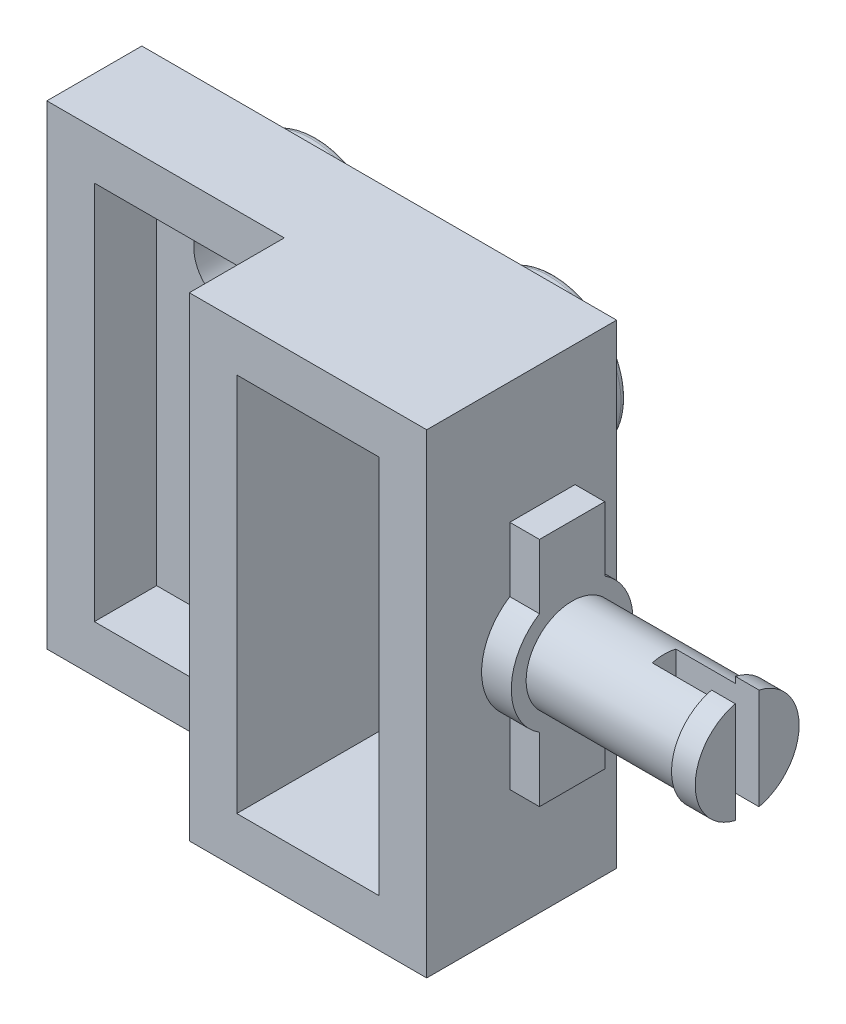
ISO-10303-21;
HEADER;
FILE_DESCRIPTION(('STEP AP214'),'2;1');
FILE_NAME('part.step','',(''),(''),'','','');
FILE_SCHEMA(('AUTOMOTIVE_DESIGN { 1 0 10303 214 1 1 1 1 }'));
ENDSEC;
DATA;
#1=APPLICATION_CONTEXT('core data for automotive mechanical design processes');
#2=APPLICATION_PROTOCOL_DEFINITION('international standard','automotive_design',2000,#1);
#3=PRODUCT_CONTEXT('',#1,'mechanical');
#4=PRODUCT('Part','Part','',(#3));
#5=PRODUCT_RELATED_PRODUCT_CATEGORY('part','',(#4));
#6=PRODUCT_DEFINITION_FORMATION('','',#4);
#7=PRODUCT_DEFINITION_CONTEXT('part definition',#1,'design');
#8=PRODUCT_DEFINITION('design','',#6,#7);
#9=PRODUCT_DEFINITION_SHAPE('','',#8);
#10=(LENGTH_UNIT() NAMED_UNIT(*) SI_UNIT(.MILLI.,.METRE.));
#11=(NAMED_UNIT(*) PLANE_ANGLE_UNIT() SI_UNIT($,.RADIAN.));
#12=(NAMED_UNIT(*) SI_UNIT($,.STERADIAN.) SOLID_ANGLE_UNIT());
#13=UNCERTAINTY_MEASURE_WITH_UNIT(LENGTH_MEASURE(1.E-05),#10,'distance_accuracy_value','');
#14=(GEOMETRIC_REPRESENTATION_CONTEXT(3) GLOBAL_UNCERTAINTY_ASSIGNED_CONTEXT((#13)) GLOBAL_UNIT_ASSIGNED_CONTEXT((#10,
#11,#12)) REPRESENTATION_CONTEXT('',''));
#15=CARTESIAN_POINT('',(0.,0.,0.));
#16=DIRECTION('',(0.,0.,1.));
#17=DIRECTION('',(1.,0.,0.));
#18=AXIS2_PLACEMENT_3D('',#15,#16,#17);
#19=CARTESIAN_POINT('',(6.1,-8.,2.5));
#20=DIRECTION('',(1.,0.,0.));
#21=DIRECTION('',(0.,1.,0.));
#22=AXIS2_PLACEMENT_3D('',#19,#20,#21);
#23=PLANE('',#22);
#24=CARTESIAN_POINT('',(6.1,-8.,2.5));
#25=DIRECTION('',(1.,0.,0.));
#26=DIRECTION('',(0.,1.,0.));
#27=AXIS2_PLACEMENT_3D('',#24,#25,#26);
#28=CIRCLE('',#27,1.75);
#29=CARTESIAN_POINT('',(6.1,-9.70367250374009,2.1));
#30=VERTEX_POINT('',#29);
#31=CARTESIAN_POINT('',(6.1,-6.29632749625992,2.1));
#32=VERTEX_POINT('',#31);
#33=EDGE_CURVE('E510',#30,#32,#28,.T.);
#34=ORIENTED_EDGE('',*,*,#33,.F.);
#35=DIRECTION('',(0.,1.,0.));
#36=VECTOR('',#35,1.);
#37=CARTESIAN_POINT('',(6.1,-8.,2.1));
#38=LINE('',#37,#36);
#39=CARTESIAN_POINT('',(6.1,-9.4974979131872,2.1));
#40=VERTEX_POINT('',#39);
#41=EDGE_CURVE('E503',#30,#40,#38,.T.);
#42=ORIENTED_EDGE('',*,*,#41,.T.);
#43=CARTESIAN_POINT('',(6.1,-8.,2.5));
#44=DIRECTION('',(1.,0.,0.));
#45=DIRECTION('',(0.,1.,0.));
#46=AXIS2_PLACEMENT_3D('',#43,#44,#45);
#47=CIRCLE('',#46,1.55);
#48=CARTESIAN_POINT('',(6.1,-6.50250208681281,2.1));
#49=VERTEX_POINT('',#48);
#50=EDGE_CURVE('E243',#40,#49,#47,.T.);
#51=ORIENTED_EDGE('',*,*,#50,.T.);
#52=EDGE_CURVE('E497',#49,#32,#38,.T.);
#53=ORIENTED_EDGE('',*,*,#52,.T.);
#54=EDGE_LOOP('',(#34,#42,#51,#53));
#55=FACE_BOUND('',#54,.T.);
#56=ADVANCED_FACE('F27',(#55),#23,.F.);
#57=CARTESIAN_POINT('',(6.9,-8.,2.5));
#58=DIRECTION('',(-1.,0.,0.));
#59=DIRECTION('',(0.,-1.,0.));
#60=AXIS2_PLACEMENT_3D('',#57,#58,#59);
#61=CYLINDRICAL_SURFACE('',#60,1.75);
#62=CARTESIAN_POINT('',(6.9,-8.,2.5));
#63=DIRECTION('',(1.,0.,0.));
#64=DIRECTION('',(0.,1.,0.));
#65=AXIS2_PLACEMENT_3D('',#62,#63,#64);
#66=CIRCLE('',#65,1.75);
#67=CARTESIAN_POINT('',(6.9,-9.70367250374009,2.1));
#68=VERTEX_POINT('',#67);
#69=CARTESIAN_POINT('',(6.9,-6.29632749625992,2.1));
#70=VERTEX_POINT('',#69);
#71=EDGE_CURVE('E240',#68,#70,#66,.T.);
#72=ORIENTED_EDGE('',*,*,#71,.F.);
#73=DIRECTION('',(1.,0.,0.));
#74=VECTOR('',#73,1.);
#75=CARTESIAN_POINT('',(4.1,-9.70367250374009,2.1));
#76=LINE('',#75,#74);
#77=EDGE_CURVE('E236',#30,#68,#76,.T.);
#78=ORIENTED_EDGE('',*,*,#77,.F.);
#79=ORIENTED_EDGE('',*,*,#33,.T.);
#80=DIRECTION('',(1.,0.,0.));
#81=VECTOR('',#80,1.);
#82=CARTESIAN_POINT('',(4.1,-6.29632749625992,2.1));
#83=LINE('',#82,#81);
#84=EDGE_CURVE('E520',#32,#70,#83,.T.);
#85=ORIENTED_EDGE('',*,*,#84,.T.);
#86=EDGE_LOOP('',(#72,#78,#79,#85));
#87=FACE_BOUND('',#86,.T.);
#88=ADVANCED_FACE('F523',(#87),#61,.T.);
#89=CARTESIAN_POINT('',(6.9,-8.,2.5));
#90=DIRECTION('',(1.,0.,0.));
#91=DIRECTION('',(0.,1.,0.));
#92=AXIS2_PLACEMENT_3D('',#89,#90,#91);
#93=PLANE('',#92);
#94=DIRECTION('',(0.,1.,0.));
#95=VECTOR('',#94,1.);
#96=CARTESIAN_POINT('',(6.9,-6.29632749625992,2.1));
#97=LINE('',#96,#95);
#98=EDGE_CURVE('E228',#68,#70,#97,.T.);
#99=ORIENTED_EDGE('',*,*,#98,.F.);
#100=ORIENTED_EDGE('',*,*,#71,.T.);
#101=EDGE_LOOP('',(#99,#100));
#102=FACE_BOUND('',#101,.T.);
#103=ADVANCED_FACE('F547',(#102),#93,.T.);
#104=CARTESIAN_POINT('',(1.,-8.,2.5));
#105=DIRECTION('',(1.,0.,0.));
#106=DIRECTION('',(0.,1.,0.));
#107=AXIS2_PLACEMENT_3D('',#104,#105,#106);
#108=PLANE('',#107);
#109=CARTESIAN_POINT('',(1.,-8.,2.5));
#110=DIRECTION('',(1.,0.,0.));
#111=DIRECTION('',(0.,1.,0.));
#112=AXIS2_PLACEMENT_3D('',#109,#110,#111);
#113=CIRCLE('',#112,2.05);
#114=CARTESIAN_POINT('',(1.,-6.27011561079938,3.6));
#115=VERTEX_POINT('',#114);
#116=CARTESIAN_POINT('',(1.,-9.72988438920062,3.6));
#117=VERTEX_POINT('',#116);
#118=EDGE_CURVE('E274',#115,#117,#113,.T.);
#119=ORIENTED_EDGE('',*,*,#118,.T.);
#120=DIRECTION('',(0.,-1.,0.));
#121=VECTOR('',#120,1.);
#122=CARTESIAN_POINT('',(1.,-9.72988438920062,3.6));
#123=LINE('',#122,#121);
#124=CARTESIAN_POINT('',(1.,-11.9,3.6));
#125=VERTEX_POINT('',#124);
#126=EDGE_CURVE('E277',#117,#125,#123,.T.);
#127=ORIENTED_EDGE('',*,*,#126,.T.);
#128=DIRECTION('',(0.,0.,-1.));
#129=VECTOR('',#128,1.);
#130=CARTESIAN_POINT('',(1.,-11.9,3.6));
#131=LINE('',#130,#129);
#132=CARTESIAN_POINT('',(1.,-11.9,1.4));
#133=VERTEX_POINT('',#132);
#134=EDGE_CURVE('E279',#125,#133,#131,.T.);
#135=ORIENTED_EDGE('',*,*,#134,.T.);
#136=DIRECTION('',(0.,1.,0.));
#137=VECTOR('',#136,1.);
#138=CARTESIAN_POINT('',(1.,-9.72988438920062,1.4));
#139=LINE('',#138,#137);
#140=CARTESIAN_POINT('',(1.,-9.72988438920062,1.4));
#141=VERTEX_POINT('',#140);
#142=EDGE_CURVE('E281',#133,#141,#139,.T.);
#143=ORIENTED_EDGE('',*,*,#142,.T.);
#144=CARTESIAN_POINT('',(1.,-8.,2.5));
#145=DIRECTION('',(1.,0.,0.));
#146=DIRECTION('',(0.,1.,0.));
#147=AXIS2_PLACEMENT_3D('',#144,#145,#146);
#148=CIRCLE('',#147,2.05);
#149=CARTESIAN_POINT('',(1.,-6.27011561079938,1.4));
#150=VERTEX_POINT('',#149);
#151=EDGE_CURVE('E283',#141,#150,#148,.T.);
#152=ORIENTED_EDGE('',*,*,#151,.T.);
#153=DIRECTION('',(0.,1.,0.));
#154=VECTOR('',#153,1.);
#155=CARTESIAN_POINT('',(1.,-6.27011561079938,1.4));
#156=LINE('',#155,#154);
#157=CARTESIAN_POINT('',(1.,-4.1,1.4));
#158=VERTEX_POINT('',#157);
#159=EDGE_CURVE('E285',#150,#158,#156,.T.);
#160=ORIENTED_EDGE('',*,*,#159,.T.);
#161=DIRECTION('',(0.,0.,1.));
#162=VECTOR('',#161,1.);
#163=CARTESIAN_POINT('',(1.,-4.1,3.6));
#164=LINE('',#163,#162);
#165=CARTESIAN_POINT('',(1.,-4.1,3.6));
#166=VERTEX_POINT('',#165);
#167=EDGE_CURVE('E287',#158,#166,#164,.T.);
#168=ORIENTED_EDGE('',*,*,#167,.T.);
#169=DIRECTION('',(0.,-1.,0.));
#170=VECTOR('',#169,1.);
#171=CARTESIAN_POINT('',(1.,-6.27011561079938,3.6));
#172=LINE('',#171,#170);
#173=EDGE_CURVE('E289',#166,#115,#172,.T.);
#174=ORIENTED_EDGE('',*,*,#173,.T.);
#175=EDGE_LOOP('',(#119,#127,#135,#143,#152,#160,#168,#174));
#176=FACE_BOUND('',#175,.T.);
#177=CARTESIAN_POINT('',(1.,-8.,2.5));
#178=DIRECTION('',(1.,0.,0.));
#179=DIRECTION('',(0.,1.,0.));
#180=AXIS2_PLACEMENT_3D('',#177,#178,#179);
#181=CIRCLE('',#180,1.55);
#182=CARTESIAN_POINT('',(1.,-6.45,2.5));
#183=VERTEX_POINT('',#182);
#184=EDGE_CURVE('E239',#183,#183,#181,.T.);
#185=ORIENTED_EDGE('',*,*,#184,.F.);
#186=EDGE_LOOP('',(#185));
#187=FACE_BOUND('',#186,.T.);
#188=ADVANCED_FACE('F551',(#176,#187),#108,.T.);
#189=CARTESIAN_POINT('',(0.,0.,3.2));
#190=DIRECTION('',(-1.,0.,0.));
#191=DIRECTION('',(0.,-1.,0.));
#192=AXIS2_PLACEMENT_3D('',#189,#190,#191);
#193=PLANE('',#192);
#194=DIRECTION('',(0.,0.,-1.));
#195=VECTOR('',#194,1.);
#196=CARTESIAN_POINT('',(0.,-16.,3.2));
#197=LINE('',#196,#195);
#198=CARTESIAN_POINT('',(0.,-16.,6.4));
#199=VERTEX_POINT('',#198);
#200=CARTESIAN_POINT('',(0.,-16.,0.));
#201=VERTEX_POINT('',#200);
#202=EDGE_CURVE('E438',#199,#201,#197,.T.);
#203=ORIENTED_EDGE('',*,*,#202,.T.);
#204=DIRECTION('',(0.,1.,0.));
#205=VECTOR('',#204,1.);
#206=CARTESIAN_POINT('',(0.,0.,0.));
#207=LINE('',#206,#205);
#208=CARTESIAN_POINT('',(0.,0.,0.));
#209=VERTEX_POINT('',#208);
#210=EDGE_CURVE('E415',#201,#209,#207,.T.);
#211=ORIENTED_EDGE('',*,*,#210,.T.);
#212=DIRECTION('',(0.,0.,-1.));
#213=VECTOR('',#212,1.);
#214=CARTESIAN_POINT('',(0.,0.,3.2));
#215=LINE('',#214,#213);
#216=CARTESIAN_POINT('',(0.,0.,6.4));
#217=VERTEX_POINT('',#216);
#218=EDGE_CURVE('E446',#217,#209,#215,.T.);
#219=ORIENTED_EDGE('',*,*,#218,.F.);
#220=DIRECTION('',(0.,1.,0.));
#221=VECTOR('',#220,1.);
#222=CARTESIAN_POINT('',(0.,0.,6.4));
#223=LINE('',#222,#221);
#224=EDGE_CURVE('E337',#199,#217,#223,.T.);
#225=ORIENTED_EDGE('',*,*,#224,.F.);
#226=EDGE_LOOP('',(#203,#211,#219,#225));
#227=FACE_BOUND('',#226,.T.);
#228=CARTESIAN_POINT('',(0.,-8.,2.5));
#229=DIRECTION('',(1.,0.,0.));
#230=DIRECTION('',(0.,1.,0.));
#231=AXIS2_PLACEMENT_3D('',#228,#229,#230);
#232=CIRCLE('',#231,2.05);
#233=CARTESIAN_POINT('',(0.,-6.27011561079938,3.6));
#234=VERTEX_POINT('',#233);
#235=CARTESIAN_POINT('',(0.,-9.72988438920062,3.6));
#236=VERTEX_POINT('',#235);
#237=EDGE_CURVE('E252',#234,#236,#232,.T.);
#238=ORIENTED_EDGE('',*,*,#237,.F.);
#239=DIRECTION('',(0.,-1.,0.));
#240=VECTOR('',#239,1.);
#241=CARTESIAN_POINT('',(0.,-6.27011561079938,3.6));
#242=LINE('',#241,#240);
#243=CARTESIAN_POINT('',(0.,-4.1,3.6));
#244=VERTEX_POINT('',#243);
#245=EDGE_CURVE('E271',#244,#234,#242,.T.);
#246=ORIENTED_EDGE('',*,*,#245,.F.);
#247=DIRECTION('',(0.,0.,1.));
#248=VECTOR('',#247,1.);
#249=CARTESIAN_POINT('',(0.,-4.1,3.6));
#250=LINE('',#249,#248);
#251=CARTESIAN_POINT('',(0.,-4.1,1.4));
#252=VERTEX_POINT('',#251);
#253=EDGE_CURVE('E268',#252,#244,#250,.T.);
#254=ORIENTED_EDGE('',*,*,#253,.F.);
#255=DIRECTION('',(0.,1.,0.));
#256=VECTOR('',#255,1.);
#257=CARTESIAN_POINT('',(0.,-6.27011561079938,1.4));
#258=LINE('',#257,#256);
#259=CARTESIAN_POINT('',(0.,-6.27011561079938,1.4));
#260=VERTEX_POINT('',#259);
#261=EDGE_CURVE('E265',#260,#252,#258,.T.);
#262=ORIENTED_EDGE('',*,*,#261,.F.);
#263=CARTESIAN_POINT('',(0.,-8.,2.5));
#264=DIRECTION('',(1.,0.,0.));
#265=DIRECTION('',(0.,1.,0.));
#266=AXIS2_PLACEMENT_3D('',#263,#264,#265);
#267=CIRCLE('',#266,2.05);
#268=CARTESIAN_POINT('',(0.,-9.72988438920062,1.4));
#269=VERTEX_POINT('',#268);
#270=EDGE_CURVE('E262',#269,#260,#267,.T.);
#271=ORIENTED_EDGE('',*,*,#270,.F.);
#272=DIRECTION('',(0.,1.,0.));
#273=VECTOR('',#272,1.);
#274=CARTESIAN_POINT('',(0.,-9.72988438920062,1.4));
#275=LINE('',#274,#273);
#276=CARTESIAN_POINT('',(0.,-11.9,1.4));
#277=VERTEX_POINT('',#276);
#278=EDGE_CURVE('E259',#277,#269,#275,.T.);
#279=ORIENTED_EDGE('',*,*,#278,.F.);
#280=DIRECTION('',(0.,0.,-1.));
#281=VECTOR('',#280,1.);
#282=CARTESIAN_POINT('',(0.,-11.9,3.6));
#283=LINE('',#282,#281);
#284=CARTESIAN_POINT('',(0.,-11.9,3.6));
#285=VERTEX_POINT('',#284);
#286=EDGE_CURVE('E256',#285,#277,#283,.T.);
#287=ORIENTED_EDGE('',*,*,#286,.F.);
#288=DIRECTION('',(0.,-1.,0.));
#289=VECTOR('',#288,1.);
#290=CARTESIAN_POINT('',(0.,-9.72988438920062,3.6));
#291=LINE('',#290,#289);
#292=EDGE_CURVE('E50',#236,#285,#291,.T.);
#293=ORIENTED_EDGE('',*,*,#292,.F.);
#294=EDGE_LOOP('',(#238,#246,#254,#262,#271,#279,#287,#293));
#295=FACE_BOUND('',#294,.T.);
#296=ADVANCED_FACE('F29',(#227,#295),#193,.F.);
#297=CARTESIAN_POINT('',(0.,0.,3.2));
#298=DIRECTION('',(0.,0.,-1.));
#299=DIRECTION('',(-1.,0.,0.));
#300=AXIS2_PLACEMENT_3D('',#297,#298,#299);
#301=PLANE('',#300);
#302=DIRECTION('',(0.,-1.,0.));
#303=VECTOR('',#302,1.);
#304=CARTESIAN_POINT('',(-8.,0.,3.2));
#305=LINE('',#304,#303);
#306=CARTESIAN_POINT('',(-8.,0.,3.2));
#307=VERTEX_POINT('',#306);
#308=CARTESIAN_POINT('',(-8.,-1.6,3.2));
#309=VERTEX_POINT('',#308);
#310=EDGE_CURVE('E349',#307,#309,#305,.T.);
#311=ORIENTED_EDGE('',*,*,#310,.F.);
#312=DIRECTION('',(-1.,0.,0.));
#313=VECTOR('',#312,1.);
#314=CARTESIAN_POINT('',(0.,0.,3.2));
#315=LINE('',#314,#313);
#316=CARTESIAN_POINT('',(-16.,0.,3.2));
#317=VERTEX_POINT('',#316);
#318=EDGE_CURVE('E431',#307,#317,#315,.T.);
#319=ORIENTED_EDGE('',*,*,#318,.T.);
#320=DIRECTION('',(0.,-1.,0.));
#321=VECTOR('',#320,1.);
#322=CARTESIAN_POINT('',(-16.,0.,3.2));
#323=LINE('',#322,#321);
#324=CARTESIAN_POINT('',(-16.,-16.,3.2));
#325=VERTEX_POINT('',#324);
#326=EDGE_CURVE('E433',#317,#325,#323,.T.);
#327=ORIENTED_EDGE('',*,*,#326,.T.);
#328=DIRECTION('',(1.,0.,0.));
#329=VECTOR('',#328,1.);
#330=CARTESIAN_POINT('',(0.,-16.,3.2));
#331=LINE('',#330,#329);
#332=CARTESIAN_POINT('',(-8.,-16.,3.2));
#333=VERTEX_POINT('',#332);
#334=EDGE_CURVE('E435',#325,#333,#331,.T.);
#335=ORIENTED_EDGE('',*,*,#334,.T.);
#336=CARTESIAN_POINT('',(-8.,-14.4,3.2));
#337=VERTEX_POINT('',#336);
#338=EDGE_CURVE('E352',#337,#333,#305,.T.);
#339=ORIENTED_EDGE('',*,*,#338,.F.);
#340=DIRECTION('',(1.,0.,0.));
#341=VECTOR('',#340,1.);
#342=CARTESIAN_POINT('',(-1.6,-14.4,3.2));
#343=LINE('',#342,#341);
#344=CARTESIAN_POINT('',(-14.4,-14.4,3.2));
#345=VERTEX_POINT('',#344);
#346=EDGE_CURVE('E395',#345,#337,#343,.T.);
#347=ORIENTED_EDGE('',*,*,#346,.F.);
#348=DIRECTION('',(0.,-1.,0.));
#349=VECTOR('',#348,1.);
#350=CARTESIAN_POINT('',(-14.4,-14.4,3.2));
#351=LINE('',#350,#349);
#352=CARTESIAN_POINT('',(-14.4,-1.6,3.2));
#353=VERTEX_POINT('',#352);
#354=EDGE_CURVE('E392',#353,#345,#351,.T.);
#355=ORIENTED_EDGE('',*,*,#354,.F.);
#356=DIRECTION('',(-1.,0.,0.));
#357=VECTOR('',#356,1.);
#358=CARTESIAN_POINT('',(-1.6,-1.6,3.2));
#359=LINE('',#358,#357);
#360=EDGE_CURVE('E390',#309,#353,#359,.T.);
#361=ORIENTED_EDGE('',*,*,#360,.F.);
#362=EDGE_LOOP('',(#311,#319,#327,#335,#339,#347,#355,#361));
#363=FACE_BOUND('',#362,.T.);
#364=ADVANCED_FACE('F708',(#363),#301,.F.);
#365=CARTESIAN_POINT('',(-1.6,-14.4,1.1));
#366=DIRECTION('',(0.,-1.,0.));
#367=DIRECTION('',(1.,0.,0.));
#368=AXIS2_PLACEMENT_3D('',#365,#366,#367);
#369=PLANE('',#368);
#370=DIRECTION('',(0.,0.,1.));
#371=VECTOR('',#370,1.);
#372=CARTESIAN_POINT('',(-8.,-14.4,1.1));
#373=LINE('',#372,#371);
#374=CARTESIAN_POINT('',(-8.,-14.4,1.1));
#375=VERTEX_POINT('',#374);
#376=EDGE_CURVE('E351',#375,#337,#373,.T.);
#377=ORIENTED_EDGE('',*,*,#376,.F.);
#378=DIRECTION('',(1.,0.,0.));
#379=VECTOR('',#378,1.);
#380=CARTESIAN_POINT('',(-1.6,-14.4,1.1));
#381=LINE('',#380,#379);
#382=CARTESIAN_POINT('',(-14.4,-14.4,1.1));
#383=VERTEX_POINT('',#382);
#384=EDGE_CURVE('E409',#383,#375,#381,.T.);
#385=ORIENTED_EDGE('',*,*,#384,.F.);
#386=DIRECTION('',(0.,0.,1.));
#387=VECTOR('',#386,1.);
#388=CARTESIAN_POINT('',(-14.4,-14.4,1.1));
#389=LINE('',#388,#387);
#390=EDGE_CURVE('E416',#383,#345,#389,.T.);
#391=ORIENTED_EDGE('',*,*,#390,.T.);
#392=ORIENTED_EDGE('',*,*,#346,.T.);
#393=EDGE_LOOP('',(#377,#385,#391,#392));
#394=FACE_BOUND('',#393,.T.);
#395=ADVANCED_FACE('F691',(#394),#369,.F.);
#396=CARTESIAN_POINT('',(-1.6,-1.6,1.1));
#397=DIRECTION('',(0.,1.,0.));
#398=DIRECTION('',(-1.,0.,0.));
#399=AXIS2_PLACEMENT_3D('',#396,#397,#398);
#400=PLANE('',#399);
#401=DIRECTION('',(0.,0.,-1.));
#402=VECTOR('',#401,1.);
#403=CARTESIAN_POINT('',(-8.,-1.6,1.1));
#404=LINE('',#403,#402);
#405=CARTESIAN_POINT('',(-8.,-1.6,1.1));
#406=VERTEX_POINT('',#405);
#407=EDGE_CURVE('E347',#309,#406,#404,.T.);
#408=ORIENTED_EDGE('',*,*,#407,.F.);
#409=ORIENTED_EDGE('',*,*,#360,.T.);
#410=DIRECTION('',(0.,0.,1.));
#411=VECTOR('',#410,1.);
#412=CARTESIAN_POINT('',(-14.4,-1.6,1.1));
#413=LINE('',#412,#411);
#414=CARTESIAN_POINT('',(-14.4,-1.6,1.1));
#415=VERTEX_POINT('',#414);
#416=EDGE_CURVE('E418',#415,#353,#413,.T.);
#417=ORIENTED_EDGE('',*,*,#416,.F.);
#418=DIRECTION('',(-1.,0.,0.));
#419=VECTOR('',#418,1.);
#420=CARTESIAN_POINT('',(-1.6,-1.6,1.1));
#421=LINE('',#420,#419);
#422=EDGE_CURVE('E401',#406,#415,#421,.T.);
#423=ORIENTED_EDGE('',*,*,#422,.F.);
#424=EDGE_LOOP('',(#408,#409,#417,#423));
#425=FACE_BOUND('',#424,.T.);
#426=ADVANCED_FACE('F699',(#425),#400,.F.);
#427=CARTESIAN_POINT('',(-1.6,-1.6,1.1));
#428=DIRECTION('',(0.,0.,1.));
#429=DIRECTION('',(1.,0.,0.));
#430=AXIS2_PLACEMENT_3D('',#427,#428,#429);
#431=PLANE('',#430);
#432=CARTESIAN_POINT('',(-11.9,-11.9,1.1));
#433=DIRECTION('',(0.,0.,1.));
#434=DIRECTION('',(1.,0.,0.));
#435=AXIS2_PLACEMENT_3D('',#432,#433,#434);
#436=CIRCLE('',#435,1.25);
#437=CARTESIAN_POINT('',(-10.65,-11.9,1.1));
#438=VERTEX_POINT('',#437);
#439=EDGE_CURVE('E354',#438,#438,#436,.T.);
#440=ORIENTED_EDGE('',*,*,#439,.F.);
#441=EDGE_LOOP('',(#440));
#442=FACE_BOUND('',#441,.T.);
#443=CARTESIAN_POINT('',(-11.9,-3.9,1.1));
#444=DIRECTION('',(0.,0.,1.));
#445=DIRECTION('',(1.,0.,0.));
#446=AXIS2_PLACEMENT_3D('',#443,#444,#445);
#447=CIRCLE('',#446,1.25);
#448=CARTESIAN_POINT('',(-10.65,-3.9,1.1));
#449=VERTEX_POINT('',#448);
#450=EDGE_CURVE('E366',#449,#449,#447,.T.);
#451=ORIENTED_EDGE('',*,*,#450,.F.);
#452=EDGE_LOOP('',(#451));
#453=FACE_BOUND('',#452,.T.);
#454=ORIENTED_EDGE('',*,*,#384,.T.);
#455=DIRECTION('',(0.,1.,0.));
#456=VECTOR('',#455,1.);
#457=CARTESIAN_POINT('',(-8.,-1.6,1.1));
#458=LINE('',#457,#456);
#459=EDGE_CURVE('E471',#375,#406,#458,.T.);
#460=ORIENTED_EDGE('',*,*,#459,.T.);
#461=ORIENTED_EDGE('',*,*,#422,.T.);
#462=DIRECTION('',(0.,-1.,0.));
#463=VECTOR('',#462,1.);
#464=CARTESIAN_POINT('',(-14.4,-14.4,1.1));
#465=LINE('',#464,#463);
#466=EDGE_CURVE('E405',#415,#383,#465,.T.);
#467=ORIENTED_EDGE('',*,*,#466,.T.);
#468=EDGE_LOOP('',(#454,#460,#461,#467));
#469=FACE_BOUND('',#468,.T.);
#470=ADVANCED_FACE('F686',(#442,#453,#469),#431,.T.);
#471=CARTESIAN_POINT('',(0.,0.,0.));
#472=DIRECTION('',(0.,0.,-1.));
#473=DIRECTION('',(-1.,0.,0.));
#474=AXIS2_PLACEMENT_3D('',#471,#472,#473);
#475=PLANE('',#474);
#476=CARTESIAN_POINT('',(-4.,-12.,0.));
#477=DIRECTION('',(0.,0.,-1.));
#478=DIRECTION('',(-1.,0.,0.));
#479=AXIS2_PLACEMENT_3D('',#476,#477,#478);
#480=CIRCLE('',#479,2.45);
#481=CARTESIAN_POINT('',(-1.54999999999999,-12.,0.));
#482=VERTEX_POINT('',#481);
#483=EDGE_CURVE('E375',#482,#482,#480,.T.);
#484=ORIENTED_EDGE('',*,*,#483,.F.);
#485=EDGE_LOOP('',(#484));
#486=FACE_BOUND('',#485,.T.);
#487=CARTESIAN_POINT('',(-4.,-4.,0.));
#488=DIRECTION('',(0.,0.,-1.));
#489=DIRECTION('',(-1.,0.,0.));
#490=AXIS2_PLACEMENT_3D('',#487,#488,#489);
#491=CIRCLE('',#490,2.45);
#492=CARTESIAN_POINT('',(-1.55,-4.,0.));
#493=VERTEX_POINT('',#492);
#494=EDGE_CURVE('E387',#493,#493,#491,.T.);
#495=ORIENTED_EDGE('',*,*,#494,.F.);
#496=EDGE_LOOP('',(#495));
#497=FACE_BOUND('',#496,.T.);
#498=ORIENTED_EDGE('',*,*,#210,.F.);
#499=DIRECTION('',(1.,0.,0.));
#500=VECTOR('',#499,1.);
#501=CARTESIAN_POINT('',(0.,-16.,0.));
#502=LINE('',#501,#500);
#503=CARTESIAN_POINT('',(-16.,-16.,0.));
#504=VERTEX_POINT('',#503);
#505=EDGE_CURVE('E428',#504,#201,#502,.T.);
#506=ORIENTED_EDGE('',*,*,#505,.F.);
#507=DIRECTION('',(0.,-1.,0.));
#508=VECTOR('',#507,1.);
#509=CARTESIAN_POINT('',(-16.,0.,0.));
#510=LINE('',#509,#508);
#511=CARTESIAN_POINT('',(-16.,0.,0.));
#512=VERTEX_POINT('',#511);
#513=EDGE_CURVE('E426',#512,#504,#510,.T.);
#514=ORIENTED_EDGE('',*,*,#513,.F.);
#515=DIRECTION('',(-1.,0.,0.));
#516=VECTOR('',#515,1.);
#517=CARTESIAN_POINT('',(0.,0.,0.));
#518=LINE('',#517,#516);
#519=EDGE_CURVE('E424',#209,#512,#518,.T.);
#520=ORIENTED_EDGE('',*,*,#519,.F.);
#521=EDGE_LOOP('',(#498,#506,#514,#520));
#522=FACE_BOUND('',#521,.T.);
#523=CARTESIAN_POINT('',(-12.,-4.,0.));
#524=DIRECTION('',(0.,0.,-1.));
#525=DIRECTION('',(-1.,0.,0.));
#526=AXIS2_PLACEMENT_3D('',#523,#524,#525);
#527=CIRCLE('',#526,2.45);
#528=CARTESIAN_POINT('',(-9.55,-4.,0.));
#529=VERTEX_POINT('',#528);
#530=EDGE_CURVE('E378',#529,#529,#527,.T.);
#531=ORIENTED_EDGE('',*,*,#530,.F.);
#532=EDGE_LOOP('',(#531));
#533=FACE_BOUND('',#532,.T.);
#534=CARTESIAN_POINT('',(-12.,-12.,0.));
#535=DIRECTION('',(0.,0.,-1.));
#536=DIRECTION('',(-1.,0.,0.));
#537=AXIS2_PLACEMENT_3D('',#534,#535,#536);
#538=CIRCLE('',#537,2.45);
#539=CARTESIAN_POINT('',(-9.54999999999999,-12.,0.));
#540=VERTEX_POINT('',#539);
#541=EDGE_CURVE('E372',#540,#540,#538,.T.);
#542=ORIENTED_EDGE('',*,*,#541,.F.);
#543=EDGE_LOOP('',(#542));
#544=FACE_BOUND('',#543,.T.);
#545=ADVANCED_FACE('F703',(#486,#497,#522,#533,#544),#475,.T.);
#546=CARTESIAN_POINT('',(0.,0.,3.2));
#547=DIRECTION('',(0.,-1.,0.));
#548=DIRECTION('',(1.,0.,0.));
#549=AXIS2_PLACEMENT_3D('',#546,#547,#548);
#550=PLANE('',#549);
#551=ORIENTED_EDGE('',*,*,#218,.T.);
#552=ORIENTED_EDGE('',*,*,#519,.T.);
#553=DIRECTION('',(0.,0.,-1.));
#554=VECTOR('',#553,1.);
#555=CARTESIAN_POINT('',(-16.,0.,3.2));
#556=LINE('',#555,#554);
#557=EDGE_CURVE('E443',#317,#512,#556,.T.);
#558=ORIENTED_EDGE('',*,*,#557,.F.);
#559=ORIENTED_EDGE('',*,*,#318,.F.);
#560=DIRECTION('',(0.,0.,-1.));
#561=VECTOR('',#560,1.);
#562=CARTESIAN_POINT('',(-8.,0.,6.4));
#563=LINE('',#562,#561);
#564=CARTESIAN_POINT('',(-8.,0.,6.4));
#565=VERTEX_POINT('',#564);
#566=EDGE_CURVE('E342',#565,#307,#563,.T.);
#567=ORIENTED_EDGE('',*,*,#566,.F.);
#568=DIRECTION('',(-1.,0.,0.));
#569=VECTOR('',#568,1.);
#570=CARTESIAN_POINT('',(-8.,0.,6.4));
#571=LINE('',#570,#569);
#572=EDGE_CURVE('E340',#217,#565,#571,.T.);
#573=ORIENTED_EDGE('',*,*,#572,.F.);
#574=EDGE_LOOP('',(#551,#552,#558,#559,#567,#573));
#575=FACE_BOUND('',#574,.T.);
#576=ADVANCED_FACE('F706',(#575),#550,.F.);
#577=CARTESIAN_POINT('',(-16.,0.,3.2));
#578=DIRECTION('',(1.,0.,0.));
#579=DIRECTION('',(0.,1.,0.));
#580=AXIS2_PLACEMENT_3D('',#577,#578,#579);
#581=PLANE('',#580);
#582=ORIENTED_EDGE('',*,*,#513,.T.);
#583=DIRECTION('',(0.,0.,-1.));
#584=VECTOR('',#583,1.);
#585=CARTESIAN_POINT('',(-16.,-16.,3.2));
#586=LINE('',#585,#584);
#587=EDGE_CURVE('E440',#325,#504,#586,.T.);
#588=ORIENTED_EDGE('',*,*,#587,.F.);
#589=ORIENTED_EDGE('',*,*,#326,.F.);
#590=ORIENTED_EDGE('',*,*,#557,.T.);
#591=EDGE_LOOP('',(#582,#588,#589,#590));
#592=FACE_BOUND('',#591,.T.);
#593=ADVANCED_FACE('F714',(#592),#581,.F.);
#594=CARTESIAN_POINT('',(0.,-16.,3.2));
#595=DIRECTION('',(0.,1.,0.));
#596=DIRECTION('',(-1.,0.,0.));
#597=AXIS2_PLACEMENT_3D('',#594,#595,#596);
#598=PLANE('',#597);
#599=ORIENTED_EDGE('',*,*,#505,.T.);
#600=ORIENTED_EDGE('',*,*,#202,.F.);
#601=DIRECTION('',(1.,0.,0.));
#602=VECTOR('',#601,1.);
#603=CARTESIAN_POINT('',(-8.,-16.,6.4));
#604=LINE('',#603,#602);
#605=CARTESIAN_POINT('',(-8.,-16.,6.4));
#606=VERTEX_POINT('',#605);
#607=EDGE_CURVE('E334',#606,#199,#604,.T.);
#608=ORIENTED_EDGE('',*,*,#607,.F.);
#609=DIRECTION('',(0.,0.,-1.));
#610=VECTOR('',#609,1.);
#611=CARTESIAN_POINT('',(-8.,-16.,6.4));
#612=LINE('',#611,#610);
#613=EDGE_CURVE('E344',#606,#333,#612,.T.);
#614=ORIENTED_EDGE('',*,*,#613,.T.);
#615=ORIENTED_EDGE('',*,*,#334,.F.);
#616=ORIENTED_EDGE('',*,*,#587,.T.);
#617=EDGE_LOOP('',(#599,#600,#608,#614,#615,#616));
#618=FACE_BOUND('',#617,.T.);
#619=ADVANCED_FACE('F694',(#618),#598,.F.);
#620=CARTESIAN_POINT('',(-14.4,-14.4,1.1));
#621=DIRECTION('',(-1.,0.,0.));
#622=DIRECTION('',(0.,0.,1.));
#623=AXIS2_PLACEMENT_3D('',#620,#621,#622);
#624=PLANE('',#623);
#625=ORIENTED_EDGE('',*,*,#354,.T.);
#626=ORIENTED_EDGE('',*,*,#390,.F.);
#627=ORIENTED_EDGE('',*,*,#466,.F.);
#628=ORIENTED_EDGE('',*,*,#416,.T.);
#629=EDGE_LOOP('',(#625,#626,#627,#628));
#630=FACE_BOUND('',#629,.T.);
#631=ADVANCED_FACE('F680',(#630),#624,.F.);
#632=CARTESIAN_POINT('',(-4.,-4.,-1.9));
#633=DIRECTION('',(0.,0.,1.));
#634=DIRECTION('',(1.,0.,0.));
#635=AXIS2_PLACEMENT_3D('',#632,#633,#634);
#636=CYLINDRICAL_SURFACE('',#635,2.45);
#637=CARTESIAN_POINT('',(-4.,-4.,-1.7));
#638=DIRECTION('',(0.,0.,-1.));
#639=DIRECTION('',(-1.,0.,0.));
#640=AXIS2_PLACEMENT_3D('',#637,#638,#639);
#641=CIRCLE('',#640,2.45);
#642=CARTESIAN_POINT('',(-1.55,-4.,-1.7));
#643=VERTEX_POINT('',#642);
#644=EDGE_CURVE('E451',#643,#643,#641,.F.);
#645=CARTESIAN_POINT('',(-1.55,-4.,-1.7));
#646=CARTESIAN_POINT('',(-1.55,-4.,-1.68229166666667));
#647=CARTESIAN_POINT('',(-1.55,-4.,-1.66458333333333));
#648=CARTESIAN_POINT('',(-1.55,-4.,-1.62916666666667));
#649=CARTESIAN_POINT('',(-1.55,-4.,-1.61145833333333));
#650=CARTESIAN_POINT('',(-1.55,-4.,-1.57604166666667));
#651=CARTESIAN_POINT('',(-1.55,-4.,-1.55833333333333));
#652=CARTESIAN_POINT('',(-1.55,-4.,-1.52291666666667));
#653=CARTESIAN_POINT('',(-1.55,-4.,-1.50520833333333));
#654=CARTESIAN_POINT('',(-1.55,-4.,-1.46979166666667));
#655=CARTESIAN_POINT('',(-1.55,-4.,-1.45208333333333));
#656=CARTESIAN_POINT('',(-1.55,-4.,-1.41666666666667));
#657=CARTESIAN_POINT('',(-1.55,-4.,-1.39895833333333));
#658=CARTESIAN_POINT('',(-1.55,-4.,-1.36354166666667));
#659=CARTESIAN_POINT('',(-1.55,-4.,-1.34583333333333));
#660=CARTESIAN_POINT('',(-1.55,-4.,-1.31041666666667));
#661=CARTESIAN_POINT('',(-1.55,-4.,-1.29270833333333));
#662=CARTESIAN_POINT('',(-1.55,-4.,-1.25729166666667));
#663=CARTESIAN_POINT('',(-1.55,-4.,-1.23958333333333));
#664=CARTESIAN_POINT('',(-1.55,-4.,-1.20416666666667));
#665=CARTESIAN_POINT('',(-1.55,-4.,-1.18645833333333));
#666=CARTESIAN_POINT('',(-1.55,-4.,-1.15104166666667));
#667=CARTESIAN_POINT('',(-1.55,-4.,-1.13333333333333));
#668=CARTESIAN_POINT('',(-1.55,-4.,-1.09791666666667));
#669=CARTESIAN_POINT('',(-1.55,-4.,-1.08020833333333));
#670=CARTESIAN_POINT('',(-1.55,-4.,-1.04479166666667));
#671=CARTESIAN_POINT('',(-1.55,-4.,-1.02708333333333));
#672=CARTESIAN_POINT('',(-1.55,-4.,-0.991666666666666));
#673=CARTESIAN_POINT('',(-1.55,-4.,-0.973958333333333));
#674=CARTESIAN_POINT('',(-1.55,-4.,-0.938541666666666));
#675=CARTESIAN_POINT('',(-1.55,-4.,-0.920833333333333));
#676=CARTESIAN_POINT('',(-1.55,-4.,-0.885416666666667));
#677=CARTESIAN_POINT('',(-1.55,-4.,-0.867708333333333));
#678=CARTESIAN_POINT('',(-1.55,-4.,-0.832291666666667));
#679=CARTESIAN_POINT('',(-1.55,-4.,-0.814583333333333));
#680=CARTESIAN_POINT('',(-1.55,-4.,-0.779166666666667));
#681=CARTESIAN_POINT('',(-1.55,-4.,-0.761458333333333));
#682=CARTESIAN_POINT('',(-1.55,-4.,-0.726041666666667));
#683=CARTESIAN_POINT('',(-1.55,-4.,-0.708333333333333));
#684=CARTESIAN_POINT('',(-1.55,-4.,-0.672916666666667));
#685=CARTESIAN_POINT('',(-1.55,-4.,-0.655208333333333));
#686=CARTESIAN_POINT('',(-1.55,-4.,-0.619791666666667));
#687=CARTESIAN_POINT('',(-1.55,-4.,-0.602083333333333));
#688=CARTESIAN_POINT('',(-1.55,-4.,-0.566666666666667));
#689=CARTESIAN_POINT('',(-1.55,-4.,-0.548958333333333));
#690=CARTESIAN_POINT('',(-1.55,-4.,-0.513541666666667));
#691=CARTESIAN_POINT('',(-1.55,-4.,-0.495833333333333));
#692=CARTESIAN_POINT('',(-1.55,-4.,-0.460416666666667));
#693=CARTESIAN_POINT('',(-1.55,-4.,-0.442708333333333));
#694=CARTESIAN_POINT('',(-1.55,-4.,-0.407291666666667));
#695=CARTESIAN_POINT('',(-1.55,-4.,-0.389583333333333));
#696=CARTESIAN_POINT('',(-1.55,-4.,-0.354166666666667));
#697=CARTESIAN_POINT('',(-1.55,-4.,-0.336458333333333));
#698=CARTESIAN_POINT('',(-1.55,-4.,-0.301041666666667));
#699=CARTESIAN_POINT('',(-1.55,-4.,-0.283333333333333));
#700=CARTESIAN_POINT('',(-1.55,-4.,-0.247916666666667));
#701=CARTESIAN_POINT('',(-1.55,-4.,-0.230208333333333));
#702=CARTESIAN_POINT('',(-1.55,-4.,-0.194791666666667));
#703=CARTESIAN_POINT('',(-1.55,-4.,-0.177083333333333));
#704=CARTESIAN_POINT('',(-1.55,-4.,-0.141666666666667));
#705=CARTESIAN_POINT('',(-1.55,-4.,-0.123958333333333));
#706=CARTESIAN_POINT('',(-1.55,-4.,-0.0885416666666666));
#707=CARTESIAN_POINT('',(-1.55,-4.,-0.0708333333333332));
#708=CARTESIAN_POINT('',(-1.55,-4.,-0.0354166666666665));
#709=CARTESIAN_POINT('',(-1.55,-4.,-0.0177083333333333));
#710=CARTESIAN_POINT('',(-1.55,-4.,0.));
#711=B_SPLINE_CURVE_WITH_KNOTS('',3,(#645,#646,#647,#648,#649,#650,#651,#652,#653,#654,#655,
#656,#657,#658,#659,#660,#661,#662,#663,#664,#665,#666,#667,#668,#669,#670,#671,#672,#673,#674,
#675,#676,#677,#678,#679,#680,#681,#682,#683,#684,#685,#686,#687,#688,#689,#690,#691,#692,#693,
#694,#695,#696,#697,#698,#699,#700,#701,#702,#703,#704,#705,#706,#707,#708,#709,#710),
.UNSPECIFIED.,.F.,.F.,(4,2,2,2,2,2,2,2,2,2,2,2,2,2,2,2,2,2,2,2,2,2,2,2,2,2,2,2,2,2,2,2,4),(0.,
0.053125,0.10625,0.159375,0.2125,0.265625,0.31875,0.371875,0.425,0.478125,0.53125,0.584375,
0.6375,0.690625,0.74375,0.796875,0.85,0.903125,0.95625,1.009375,1.0625,1.115625,1.16875,
1.221875,1.275,1.328125,1.38125,1.434375,1.4875,1.540625,1.59375,1.646875,1.7),.UNSPECIFIED.);
#712=EDGE_CURVE('BSEAM676',#643,#493,#711,.T.);
#713=ORIENTED_EDGE('',*,*,#644,.T.);
#714=ORIENTED_EDGE('',*,*,#494,.T.);
#715=ORIENTED_EDGE('',*,*,#712,.T.);
#716=ORIENTED_EDGE('',*,*,#712,.F.);
#717=EDGE_LOOP('',(#713,#715,#714,#716));
#718=FACE_BOUND('',#717,.T.);
#719=ADVANCED_FACE('F676',(#718),#636,.T.);
#720=CARTESIAN_POINT('',(-4.,-4.,-1.9));
#721=DIRECTION('',(0.,0.,-1.));
#722=DIRECTION('',(-1.,0.,0.));
#723=AXIS2_PLACEMENT_3D('',#720,#721,#722);
#724=PLANE('',#723);
#725=CARTESIAN_POINT('',(-4.,-4.,-1.9));
#726=DIRECTION('',(0.,0.,-1.));
#727=DIRECTION('',(-1.,0.,0.));
#728=AXIS2_PLACEMENT_3D('',#725,#726,#727);
#729=CIRCLE('',#728,2.25);
#730=CARTESIAN_POINT('',(-6.25,-4.,-1.9));
#731=VERTEX_POINT('',#730);
#732=EDGE_CURVE('E448',#731,#731,#729,.T.);
#733=ORIENTED_EDGE('',*,*,#732,.T.);
#734=EDGE_LOOP('',(#733));
#735=FACE_BOUND('',#734,.T.);
#736=ADVANCED_FACE('F672',(#735),#724,.T.);
#737=CARTESIAN_POINT('',(-4.,-4.,-1.7));
#738=DIRECTION('',(0.,0.,-1.));
#739=DIRECTION('',(-1.,0.,0.));
#740=AXIS2_PLACEMENT_3D('',#737,#738,#739);
#741=TOROIDAL_SURFACE('',#740,2.25,0.2);
#742=ORIENTED_EDGE('',*,*,#644,.F.);
#743=EDGE_LOOP('',(#742));
#744=FACE_BOUND('',#743,.T.);
#745=ORIENTED_EDGE('',*,*,#732,.F.);
#746=EDGE_LOOP('',(#745));
#747=FACE_BOUND('',#746,.T.);
#748=ADVANCED_FACE('F662',(#744,#747),#741,.T.);
#749=CARTESIAN_POINT('',(-12.,-4.,-1.9));
#750=DIRECTION('',(0.,0.,1.));
#751=DIRECTION('',(1.,0.,0.));
#752=AXIS2_PLACEMENT_3D('',#749,#750,#751);
#753=CYLINDRICAL_SURFACE('',#752,2.45);
#754=CARTESIAN_POINT('',(-12.,-4.,-1.7));
#755=DIRECTION('',(0.,0.,-1.));
#756=DIRECTION('',(-1.,0.,0.));
#757=AXIS2_PLACEMENT_3D('',#754,#755,#756);
#758=CIRCLE('',#757,2.45);
#759=CARTESIAN_POINT('',(-9.55,-4.,-1.7));
#760=VERTEX_POINT('',#759);
#761=EDGE_CURVE('E457',#760,#760,#758,.F.);
#762=CARTESIAN_POINT('',(-9.55,-4.,-1.7));
#763=CARTESIAN_POINT('',(-9.55,-4.,-1.68229166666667));
#764=CARTESIAN_POINT('',(-9.55,-4.,-1.66458333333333));
#765=CARTESIAN_POINT('',(-9.55,-4.,-1.62916666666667));
#766=CARTESIAN_POINT('',(-9.55,-4.,-1.61145833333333));
#767=CARTESIAN_POINT('',(-9.55,-4.,-1.57604166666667));
#768=CARTESIAN_POINT('',(-9.55,-4.,-1.55833333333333));
#769=CARTESIAN_POINT('',(-9.55,-4.,-1.52291666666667));
#770=CARTESIAN_POINT('',(-9.55,-4.,-1.50520833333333));
#771=CARTESIAN_POINT('',(-9.55,-4.,-1.46979166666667));
#772=CARTESIAN_POINT('',(-9.55,-4.,-1.45208333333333));
#773=CARTESIAN_POINT('',(-9.55,-4.,-1.41666666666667));
#774=CARTESIAN_POINT('',(-9.55,-4.,-1.39895833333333));
#775=CARTESIAN_POINT('',(-9.55,-4.,-1.36354166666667));
#776=CARTESIAN_POINT('',(-9.55,-4.,-1.34583333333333));
#777=CARTESIAN_POINT('',(-9.55,-4.,-1.31041666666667));
#778=CARTESIAN_POINT('',(-9.55,-4.,-1.29270833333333));
#779=CARTESIAN_POINT('',(-9.55,-4.,-1.25729166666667));
#780=CARTESIAN_POINT('',(-9.55,-4.,-1.23958333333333));
#781=CARTESIAN_POINT('',(-9.55,-4.,-1.20416666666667));
#782=CARTESIAN_POINT('',(-9.55,-4.,-1.18645833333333));
#783=CARTESIAN_POINT('',(-9.55,-4.,-1.15104166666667));
#784=CARTESIAN_POINT('',(-9.55,-4.,-1.13333333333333));
#785=CARTESIAN_POINT('',(-9.55,-4.,-1.09791666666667));
#786=CARTESIAN_POINT('',(-9.55,-4.,-1.08020833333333));
#787=CARTESIAN_POINT('',(-9.55,-4.,-1.04479166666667));
#788=CARTESIAN_POINT('',(-9.55,-4.,-1.02708333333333));
#789=CARTESIAN_POINT('',(-9.55,-4.,-0.991666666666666));
#790=CARTESIAN_POINT('',(-9.55,-4.,-0.973958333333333));
#791=CARTESIAN_POINT('',(-9.55,-4.,-0.938541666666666));
#792=CARTESIAN_POINT('',(-9.55,-4.,-0.920833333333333));
#793=CARTESIAN_POINT('',(-9.55,-4.,-0.885416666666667));
#794=CARTESIAN_POINT('',(-9.55,-4.,-0.867708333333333));
#795=CARTESIAN_POINT('',(-9.55,-4.,-0.832291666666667));
#796=CARTESIAN_POINT('',(-9.55,-4.,-0.814583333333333));
#797=CARTESIAN_POINT('',(-9.55,-4.,-0.779166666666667));
#798=CARTESIAN_POINT('',(-9.55,-4.,-0.761458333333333));
#799=CARTESIAN_POINT('',(-9.55,-4.,-0.726041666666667));
#800=CARTESIAN_POINT('',(-9.55,-4.,-0.708333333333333));
#801=CARTESIAN_POINT('',(-9.55,-4.,-0.672916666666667));
#802=CARTESIAN_POINT('',(-9.55,-4.,-0.655208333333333));
#803=CARTESIAN_POINT('',(-9.55,-4.,-0.619791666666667));
#804=CARTESIAN_POINT('',(-9.55,-4.,-0.602083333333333));
#805=CARTESIAN_POINT('',(-9.55,-4.,-0.566666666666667));
#806=CARTESIAN_POINT('',(-9.55,-4.,-0.548958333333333));
#807=CARTESIAN_POINT('',(-9.55,-4.,-0.513541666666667));
#808=CARTESIAN_POINT('',(-9.55,-4.,-0.495833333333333));
#809=CARTESIAN_POINT('',(-9.55,-4.,-0.460416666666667));
#810=CARTESIAN_POINT('',(-9.55,-4.,-0.442708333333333));
#811=CARTESIAN_POINT('',(-9.55,-4.,-0.407291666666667));
#812=CARTESIAN_POINT('',(-9.55,-4.,-0.389583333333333));
#813=CARTESIAN_POINT('',(-9.55,-4.,-0.354166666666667));
#814=CARTESIAN_POINT('',(-9.55,-4.,-0.336458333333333));
#815=CARTESIAN_POINT('',(-9.55,-4.,-0.301041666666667));
#816=CARTESIAN_POINT('',(-9.55,-4.,-0.283333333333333));
#817=CARTESIAN_POINT('',(-9.55,-4.,-0.247916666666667));
#818=CARTESIAN_POINT('',(-9.55,-4.,-0.230208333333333));
#819=CARTESIAN_POINT('',(-9.55,-4.,-0.194791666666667));
#820=CARTESIAN_POINT('',(-9.55,-4.,-0.177083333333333));
#821=CARTESIAN_POINT('',(-9.55,-4.,-0.141666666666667));
#822=CARTESIAN_POINT('',(-9.55,-4.,-0.123958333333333));
#823=CARTESIAN_POINT('',(-9.55,-4.,-0.0885416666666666));
#824=CARTESIAN_POINT('',(-9.55,-4.,-0.0708333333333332));
#825=CARTESIAN_POINT('',(-9.55,-4.,-0.0354166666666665));
#826=CARTESIAN_POINT('',(-9.55,-4.,-0.0177083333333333));
#827=CARTESIAN_POINT('',(-9.55,-4.,0.));
#828=B_SPLINE_CURVE_WITH_KNOTS('',3,(#762,#763,#764,#765,#766,#767,#768,#769,#770,#771,#772,
#773,#774,#775,#776,#777,#778,#779,#780,#781,#782,#783,#784,#785,#786,#787,#788,#789,#790,#791,
#792,#793,#794,#795,#796,#797,#798,#799,#800,#801,#802,#803,#804,#805,#806,#807,#808,#809,#810,
#811,#812,#813,#814,#815,#816,#817,#818,#819,#820,#821,#822,#823,#824,#825,#826,#827),
.UNSPECIFIED.,.F.,.F.,(4,2,2,2,2,2,2,2,2,2,2,2,2,2,2,2,2,2,2,2,2,2,2,2,2,2,2,2,2,2,2,2,4),(0.,
0.053125,0.10625,0.159375,0.2125,0.265625,0.31875,0.371875,0.425,0.478125,0.53125,0.584375,
0.6375,0.690625,0.74375,0.796875,0.85,0.903125,0.95625,1.009375,1.0625,1.115625,1.16875,
1.221875,1.275,1.328125,1.38125,1.434375,1.4875,1.540625,1.59375,1.646875,1.7),.UNSPECIFIED.);
#829=EDGE_CURVE('BSEAM658',#760,#529,#828,.T.);
#830=ORIENTED_EDGE('',*,*,#761,.T.);
#831=ORIENTED_EDGE('',*,*,#530,.T.);
#832=ORIENTED_EDGE('',*,*,#829,.T.);
#833=ORIENTED_EDGE('',*,*,#829,.F.);
#834=EDGE_LOOP('',(#830,#832,#831,#833));
#835=FACE_BOUND('',#834,.T.);
#836=ADVANCED_FACE('F658',(#835),#753,.T.);
#837=CARTESIAN_POINT('',(-12.,-4.,-1.9));
#838=DIRECTION('',(0.,0.,-1.));
#839=DIRECTION('',(-1.,0.,0.));
#840=AXIS2_PLACEMENT_3D('',#837,#838,#839);
#841=PLANE('',#840);
#842=CARTESIAN_POINT('',(-12.,-4.,-1.9));
#843=DIRECTION('',(0.,0.,-1.));
#844=DIRECTION('',(-1.,0.,0.));
#845=AXIS2_PLACEMENT_3D('',#842,#843,#844);
#846=CIRCLE('',#845,2.25);
#847=CARTESIAN_POINT('',(-14.25,-4.,-1.9));
#848=VERTEX_POINT('',#847);
#849=EDGE_CURVE('E454',#848,#848,#846,.T.);
#850=ORIENTED_EDGE('',*,*,#849,.T.);
#851=EDGE_LOOP('',(#850));
#852=FACE_BOUND('',#851,.T.);
#853=ADVANCED_FACE('F654',(#852),#841,.T.);
#854=CARTESIAN_POINT('',(-4.,-12.,-1.9));
#855=DIRECTION('',(0.,0.,1.));
#856=DIRECTION('',(1.,0.,0.));
#857=AXIS2_PLACEMENT_3D('',#854,#855,#856);
#858=CYLINDRICAL_SURFACE('',#857,2.45);
#859=CARTESIAN_POINT('',(-4.,-12.,-1.7));
#860=DIRECTION('',(0.,0.,-1.));
#861=DIRECTION('',(-1.,0.,0.));
#862=AXIS2_PLACEMENT_3D('',#859,#860,#861);
#863=CIRCLE('',#862,2.45);
#864=CARTESIAN_POINT('',(-1.54999999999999,-12.,-1.7));
#865=VERTEX_POINT('',#864);
#866=EDGE_CURVE('E463',#865,#865,#863,.F.);
#867=CARTESIAN_POINT('',(-1.54999999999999,-12.,-1.7));
#868=CARTESIAN_POINT('',(-1.54999999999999,-12.,-1.68229166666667));
#869=CARTESIAN_POINT('',(-1.54999999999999,-12.,-1.66458333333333));
#870=CARTESIAN_POINT('',(-1.54999999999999,-12.,-1.62916666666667));
#871=CARTESIAN_POINT('',(-1.54999999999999,-12.,-1.61145833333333));
#872=CARTESIAN_POINT('',(-1.54999999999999,-12.,-1.57604166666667));
#873=CARTESIAN_POINT('',(-1.54999999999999,-12.,-1.55833333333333));
#874=CARTESIAN_POINT('',(-1.54999999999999,-12.,-1.52291666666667));
#875=CARTESIAN_POINT('',(-1.54999999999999,-12.,-1.50520833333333));
#876=CARTESIAN_POINT('',(-1.54999999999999,-12.,-1.46979166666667));
#877=CARTESIAN_POINT('',(-1.54999999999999,-12.,-1.45208333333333));
#878=CARTESIAN_POINT('',(-1.54999999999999,-12.,-1.41666666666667));
#879=CARTESIAN_POINT('',(-1.54999999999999,-12.,-1.39895833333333));
#880=CARTESIAN_POINT('',(-1.54999999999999,-12.,-1.36354166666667));
#881=CARTESIAN_POINT('',(-1.54999999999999,-12.,-1.34583333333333));
#882=CARTESIAN_POINT('',(-1.54999999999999,-12.,-1.31041666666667));
#883=CARTESIAN_POINT('',(-1.54999999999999,-12.,-1.29270833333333));
#884=CARTESIAN_POINT('',(-1.54999999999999,-12.,-1.25729166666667));
#885=CARTESIAN_POINT('',(-1.54999999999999,-12.,-1.23958333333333));
#886=CARTESIAN_POINT('',(-1.54999999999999,-12.,-1.20416666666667));
#887=CARTESIAN_POINT('',(-1.54999999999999,-12.,-1.18645833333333));
#888=CARTESIAN_POINT('',(-1.54999999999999,-12.,-1.15104166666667));
#889=CARTESIAN_POINT('',(-1.54999999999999,-12.,-1.13333333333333));
#890=CARTESIAN_POINT('',(-1.54999999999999,-12.,-1.09791666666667));
#891=CARTESIAN_POINT('',(-1.54999999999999,-12.,-1.08020833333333));
#892=CARTESIAN_POINT('',(-1.54999999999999,-12.,-1.04479166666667));
#893=CARTESIAN_POINT('',(-1.54999999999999,-12.,-1.02708333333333));
#894=CARTESIAN_POINT('',(-1.54999999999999,-12.,-0.991666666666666));
#895=CARTESIAN_POINT('',(-1.54999999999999,-12.,-0.973958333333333));
#896=CARTESIAN_POINT('',(-1.54999999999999,-12.,-0.938541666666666));
#897=CARTESIAN_POINT('',(-1.54999999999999,-12.,-0.920833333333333));
#898=CARTESIAN_POINT('',(-1.54999999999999,-12.,-0.885416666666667));
#899=CARTESIAN_POINT('',(-1.54999999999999,-12.,-0.867708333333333));
#900=CARTESIAN_POINT('',(-1.54999999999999,-12.,-0.832291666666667));
#901=CARTESIAN_POINT('',(-1.54999999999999,-12.,-0.814583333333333));
#902=CARTESIAN_POINT('',(-1.54999999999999,-12.,-0.779166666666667));
#903=CARTESIAN_POINT('',(-1.54999999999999,-12.,-0.761458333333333));
#904=CARTESIAN_POINT('',(-1.54999999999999,-12.,-0.726041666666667));
#905=CARTESIAN_POINT('',(-1.54999999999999,-12.,-0.708333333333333));
#906=CARTESIAN_POINT('',(-1.54999999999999,-12.,-0.672916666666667));
#907=CARTESIAN_POINT('',(-1.54999999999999,-12.,-0.655208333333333));
#908=CARTESIAN_POINT('',(-1.54999999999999,-12.,-0.619791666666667));
#909=CARTESIAN_POINT('',(-1.54999999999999,-12.,-0.602083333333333));
#910=CARTESIAN_POINT('',(-1.54999999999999,-12.,-0.566666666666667));
#911=CARTESIAN_POINT('',(-1.54999999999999,-12.,-0.548958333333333));
#912=CARTESIAN_POINT('',(-1.54999999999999,-12.,-0.513541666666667));
#913=CARTESIAN_POINT('',(-1.54999999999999,-12.,-0.495833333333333));
#914=CARTESIAN_POINT('',(-1.54999999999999,-12.,-0.460416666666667));
#915=CARTESIAN_POINT('',(-1.54999999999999,-12.,-0.442708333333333));
#916=CARTESIAN_POINT('',(-1.54999999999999,-12.,-0.407291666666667));
#917=CARTESIAN_POINT('',(-1.54999999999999,-12.,-0.389583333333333));
#918=CARTESIAN_POINT('',(-1.54999999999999,-12.,-0.354166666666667));
#919=CARTESIAN_POINT('',(-1.54999999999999,-12.,-0.336458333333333));
#920=CARTESIAN_POINT('',(-1.54999999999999,-12.,-0.301041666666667));
#921=CARTESIAN_POINT('',(-1.54999999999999,-12.,-0.283333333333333));
#922=CARTESIAN_POINT('',(-1.54999999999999,-12.,-0.247916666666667));
#923=CARTESIAN_POINT('',(-1.54999999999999,-12.,-0.230208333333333));
#924=CARTESIAN_POINT('',(-1.54999999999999,-12.,-0.194791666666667));
#925=CARTESIAN_POINT('',(-1.54999999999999,-12.,-0.177083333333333));
#926=CARTESIAN_POINT('',(-1.54999999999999,-12.,-0.141666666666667));
#927=CARTESIAN_POINT('',(-1.54999999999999,-12.,-0.123958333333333));
#928=CARTESIAN_POINT('',(-1.54999999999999,-12.,-0.0885416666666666));
#929=CARTESIAN_POINT('',(-1.54999999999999,-12.,-0.0708333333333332));
#930=CARTESIAN_POINT('',(-1.54999999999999,-12.,-0.0354166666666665));
#931=CARTESIAN_POINT('',(-1.54999999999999,-12.,-0.0177083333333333));
#932=CARTESIAN_POINT('',(-1.54999999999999,-12.,0.));
#933=B_SPLINE_CURVE_WITH_KNOTS('',3,(#867,#868,#869,#870,#871,#872,#873,#874,#875,#876,#877,
#878,#879,#880,#881,#882,#883,#884,#885,#886,#887,#888,#889,#890,#891,#892,#893,#894,#895,#896,
#897,#898,#899,#900,#901,#902,#903,#904,#905,#906,#907,#908,#909,#910,#911,#912,#913,#914,#915,
#916,#917,#918,#919,#920,#921,#922,#923,#924,#925,#926,#927,#928,#929,#930,#931,#932),
.UNSPECIFIED.,.F.,.F.,(4,2,2,2,2,2,2,2,2,2,2,2,2,2,2,2,2,2,2,2,2,2,2,2,2,2,2,2,2,2,2,2,4),(0.,
0.053125,0.10625,0.159375,0.2125,0.265625,0.31875,0.371875,0.425,0.478125,0.53125,0.584375,
0.6375,0.690625,0.74375,0.796875,0.85,0.903125,0.95625,1.009375,1.0625,1.115625,1.16875,
1.221875,1.275,1.328125,1.38125,1.434375,1.4875,1.540625,1.59375,1.646875,1.7),.UNSPECIFIED.);
#934=EDGE_CURVE('BSEAM650',#865,#482,#933,.T.);
#935=ORIENTED_EDGE('',*,*,#866,.T.);
#936=ORIENTED_EDGE('',*,*,#483,.T.);
#937=ORIENTED_EDGE('',*,*,#934,.T.);
#938=ORIENTED_EDGE('',*,*,#934,.F.);
#939=EDGE_LOOP('',(#935,#937,#936,#938));
#940=FACE_BOUND('',#939,.T.);
#941=ADVANCED_FACE('F650',(#940),#858,.T.);
#942=CARTESIAN_POINT('',(-4.,-12.,-1.9));
#943=DIRECTION('',(0.,0.,-1.));
#944=DIRECTION('',(-1.,0.,0.));
#945=AXIS2_PLACEMENT_3D('',#942,#943,#944);
#946=PLANE('',#945);
#947=CARTESIAN_POINT('',(-4.,-12.,-1.9));
#948=DIRECTION('',(0.,0.,-1.));
#949=DIRECTION('',(-1.,0.,0.));
#950=AXIS2_PLACEMENT_3D('',#947,#948,#949);
#951=CIRCLE('',#950,2.25);
#952=CARTESIAN_POINT('',(-6.25,-12.,-1.9));
#953=VERTEX_POINT('',#952);
#954=EDGE_CURVE('E460',#953,#953,#951,.T.);
#955=ORIENTED_EDGE('',*,*,#954,.T.);
#956=EDGE_LOOP('',(#955));
#957=FACE_BOUND('',#956,.T.);
#958=ADVANCED_FACE('F646',(#957),#946,.T.);
#959=CARTESIAN_POINT('',(-12.,-12.,-1.9));
#960=DIRECTION('',(0.,0.,1.));
#961=DIRECTION('',(1.,0.,0.));
#962=AXIS2_PLACEMENT_3D('',#959,#960,#961);
#963=CYLINDRICAL_SURFACE('',#962,2.45);
#964=CARTESIAN_POINT('',(-12.,-12.,-1.7));
#965=DIRECTION('',(0.,0.,-1.));
#966=DIRECTION('',(-1.,0.,0.));
#967=AXIS2_PLACEMENT_3D('',#964,#965,#966);
#968=CIRCLE('',#967,2.45);
#969=CARTESIAN_POINT('',(-9.54999999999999,-12.,-1.7));
#970=VERTEX_POINT('',#969);
#971=EDGE_CURVE('E469',#970,#970,#968,.F.);
#972=CARTESIAN_POINT('',(-9.54999999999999,-12.,-1.7));
#973=CARTESIAN_POINT('',(-9.54999999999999,-12.,-1.68229166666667));
#974=CARTESIAN_POINT('',(-9.54999999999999,-12.,-1.66458333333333));
#975=CARTESIAN_POINT('',(-9.54999999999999,-12.,-1.62916666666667));
#976=CARTESIAN_POINT('',(-9.54999999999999,-12.,-1.61145833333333));
#977=CARTESIAN_POINT('',(-9.54999999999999,-12.,-1.57604166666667));
#978=CARTESIAN_POINT('',(-9.54999999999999,-12.,-1.55833333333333));
#979=CARTESIAN_POINT('',(-9.54999999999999,-12.,-1.52291666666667));
#980=CARTESIAN_POINT('',(-9.54999999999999,-12.,-1.50520833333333));
#981=CARTESIAN_POINT('',(-9.54999999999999,-12.,-1.46979166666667));
#982=CARTESIAN_POINT('',(-9.54999999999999,-12.,-1.45208333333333));
#983=CARTESIAN_POINT('',(-9.54999999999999,-12.,-1.41666666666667));
#984=CARTESIAN_POINT('',(-9.54999999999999,-12.,-1.39895833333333));
#985=CARTESIAN_POINT('',(-9.54999999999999,-12.,-1.36354166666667));
#986=CARTESIAN_POINT('',(-9.54999999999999,-12.,-1.34583333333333));
#987=CARTESIAN_POINT('',(-9.54999999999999,-12.,-1.31041666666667));
#988=CARTESIAN_POINT('',(-9.54999999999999,-12.,-1.29270833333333));
#989=CARTESIAN_POINT('',(-9.54999999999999,-12.,-1.25729166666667));
#990=CARTESIAN_POINT('',(-9.54999999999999,-12.,-1.23958333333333));
#991=CARTESIAN_POINT('',(-9.54999999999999,-12.,-1.20416666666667));
#992=CARTESIAN_POINT('',(-9.54999999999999,-12.,-1.18645833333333));
#993=CARTESIAN_POINT('',(-9.54999999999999,-12.,-1.15104166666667));
#994=CARTESIAN_POINT('',(-9.54999999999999,-12.,-1.13333333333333));
#995=CARTESIAN_POINT('',(-9.54999999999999,-12.,-1.09791666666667));
#996=CARTESIAN_POINT('',(-9.54999999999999,-12.,-1.08020833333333));
#997=CARTESIAN_POINT('',(-9.54999999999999,-12.,-1.04479166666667));
#998=CARTESIAN_POINT('',(-9.54999999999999,-12.,-1.02708333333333));
#999=CARTESIAN_POINT('',(-9.54999999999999,-12.,-0.991666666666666));
#1000=CARTESIAN_POINT('',(-9.54999999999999,-12.,-0.973958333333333));
#1001=CARTESIAN_POINT('',(-9.54999999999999,-12.,-0.938541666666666));
#1002=CARTESIAN_POINT('',(-9.54999999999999,-12.,-0.920833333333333));
#1003=CARTESIAN_POINT('',(-9.54999999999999,-12.,-0.885416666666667));
#1004=CARTESIAN_POINT('',(-9.54999999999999,-12.,-0.867708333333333));
#1005=CARTESIAN_POINT('',(-9.54999999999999,-12.,-0.832291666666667));
#1006=CARTESIAN_POINT('',(-9.54999999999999,-12.,-0.814583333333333));
#1007=CARTESIAN_POINT('',(-9.54999999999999,-12.,-0.779166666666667));
#1008=CARTESIAN_POINT('',(-9.54999999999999,-12.,-0.761458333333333));
#1009=CARTESIAN_POINT('',(-9.54999999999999,-12.,-0.726041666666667));
#1010=CARTESIAN_POINT('',(-9.54999999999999,-12.,-0.708333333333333));
#1011=CARTESIAN_POINT('',(-9.54999999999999,-12.,-0.672916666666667));
#1012=CARTESIAN_POINT('',(-9.54999999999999,-12.,-0.655208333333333));
#1013=CARTESIAN_POINT('',(-9.54999999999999,-12.,-0.619791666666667));
#1014=CARTESIAN_POINT('',(-9.54999999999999,-12.,-0.602083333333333));
#1015=CARTESIAN_POINT('',(-9.54999999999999,-12.,-0.566666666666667));
#1016=CARTESIAN_POINT('',(-9.54999999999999,-12.,-0.548958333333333));
#1017=CARTESIAN_POINT('',(-9.54999999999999,-12.,-0.513541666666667));
#1018=CARTESIAN_POINT('',(-9.54999999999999,-12.,-0.495833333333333));
#1019=CARTESIAN_POINT('',(-9.54999999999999,-12.,-0.460416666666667));
#1020=CARTESIAN_POINT('',(-9.54999999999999,-12.,-0.442708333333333));
#1021=CARTESIAN_POINT('',(-9.54999999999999,-12.,-0.407291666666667));
#1022=CARTESIAN_POINT('',(-9.54999999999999,-12.,-0.389583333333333));
#1023=CARTESIAN_POINT('',(-9.54999999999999,-12.,-0.354166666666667));
#1024=CARTESIAN_POINT('',(-9.54999999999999,-12.,-0.336458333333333));
#1025=CARTESIAN_POINT('',(-9.54999999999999,-12.,-0.301041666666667));
#1026=CARTESIAN_POINT('',(-9.54999999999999,-12.,-0.283333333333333));
#1027=CARTESIAN_POINT('',(-9.54999999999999,-12.,-0.247916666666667));
#1028=CARTESIAN_POINT('',(-9.54999999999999,-12.,-0.230208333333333));
#1029=CARTESIAN_POINT('',(-9.54999999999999,-12.,-0.194791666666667));
#1030=CARTESIAN_POINT('',(-9.54999999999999,-12.,-0.177083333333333));
#1031=CARTESIAN_POINT('',(-9.54999999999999,-12.,-0.141666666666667));
#1032=CARTESIAN_POINT('',(-9.54999999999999,-12.,-0.123958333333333));
#1033=CARTESIAN_POINT('',(-9.54999999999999,-12.,-0.0885416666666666));
#1034=CARTESIAN_POINT('',(-9.54999999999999,-12.,-0.0708333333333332));
#1035=CARTESIAN_POINT('',(-9.54999999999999,-12.,-0.0354166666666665));
#1036=CARTESIAN_POINT('',(-9.54999999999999,-12.,-0.0177083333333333));
#1037=CARTESIAN_POINT('',(-9.54999999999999,-12.,0.));
#1038=B_SPLINE_CURVE_WITH_KNOTS('',3,(#972,#973,#974,#975,#976,#977,#978,#979,#980,#981,#982,
#983,#984,#985,#986,#987,#988,#989,#990,#991,#992,#993,#994,#995,#996,#997,#998,#999,#1000,
#1001,#1002,#1003,#1004,#1005,#1006,#1007,#1008,#1009,#1010,#1011,#1012,#1013,#1014,#1015,#1016,
#1017,#1018,#1019,#1020,#1021,#1022,#1023,#1024,#1025,#1026,#1027,#1028,#1029,#1030,#1031,#1032,
#1033,#1034,#1035,#1036,#1037),.UNSPECIFIED.,.F.,.F.,(4,2,2,2,2,2,2,2,2,2,2,2,2,2,2,2,2,2,2,2,2,
2,2,2,2,2,2,2,2,2,2,2,4),(0.,0.053125,0.10625,0.159375,0.2125,0.265625,0.31875,0.371875,0.425,
0.478125,0.53125,0.584375,0.6375,0.690625,0.74375,0.796875,0.85,0.903125,0.95625,1.009375,
1.0625,1.115625,1.16875,1.221875,1.275,1.328125,1.38125,1.434375,1.4875,1.540625,1.59375,
1.646875,1.7),.UNSPECIFIED.);
#1039=EDGE_CURVE('BSEAM642',#970,#540,#1038,.T.);
#1040=ORIENTED_EDGE('',*,*,#971,.T.);
#1041=ORIENTED_EDGE('',*,*,#541,.T.);
#1042=ORIENTED_EDGE('',*,*,#1039,.T.);
#1043=ORIENTED_EDGE('',*,*,#1039,.F.);
#1044=EDGE_LOOP('',(#1040,#1042,#1041,#1043));
#1045=FACE_BOUND('',#1044,.T.);
#1046=ADVANCED_FACE('F642',(#1045),#963,.T.);
#1047=CARTESIAN_POINT('',(-12.,-12.,-1.9));
#1048=DIRECTION('',(0.,0.,-1.));
#1049=DIRECTION('',(-1.,0.,0.));
#1050=AXIS2_PLACEMENT_3D('',#1047,#1048,#1049);
#1051=PLANE('',#1050);
#1052=CARTESIAN_POINT('',(-12.,-12.,-1.9));
#1053=DIRECTION('',(0.,0.,-1.));
#1054=DIRECTION('',(-1.,0.,0.));
#1055=AXIS2_PLACEMENT_3D('',#1052,#1053,#1054);
#1056=CIRCLE('',#1055,2.25);
#1057=CARTESIAN_POINT('',(-14.25,-12.,-1.9));
#1058=VERTEX_POINT('',#1057);
#1059=EDGE_CURVE('E466',#1058,#1058,#1056,.T.);
#1060=ORIENTED_EDGE('',*,*,#1059,.T.);
#1061=EDGE_LOOP('',(#1060));
#1062=FACE_BOUND('',#1061,.T.);
#1063=ADVANCED_FACE('F638',(#1062),#1051,.T.);
#1064=CARTESIAN_POINT('',(-12.,-4.,-1.7));
#1065=DIRECTION('',(0.,0.,-1.));
#1066=DIRECTION('',(-1.,0.,0.));
#1067=AXIS2_PLACEMENT_3D('',#1064,#1065,#1066);
#1068=TOROIDAL_SURFACE('',#1067,2.25,0.2);
#1069=ORIENTED_EDGE('',*,*,#761,.F.);
#1070=EDGE_LOOP('',(#1069));
#1071=FACE_BOUND('',#1070,.T.);
#1072=ORIENTED_EDGE('',*,*,#849,.F.);
#1073=EDGE_LOOP('',(#1072));
#1074=FACE_BOUND('',#1073,.T.);
#1075=ADVANCED_FACE('F634',(#1071,#1074),#1068,.T.);
#1076=CARTESIAN_POINT('',(-4.,-12.,-1.7));
#1077=DIRECTION('',(0.,0.,-1.));
#1078=DIRECTION('',(-1.,0.,0.));
#1079=AXIS2_PLACEMENT_3D('',#1076,#1077,#1078);
#1080=TOROIDAL_SURFACE('',#1079,2.25,0.2);
#1081=ORIENTED_EDGE('',*,*,#866,.F.);
#1082=EDGE_LOOP('',(#1081));
#1083=FACE_BOUND('',#1082,.T.);
#1084=ORIENTED_EDGE('',*,*,#954,.F.);
#1085=EDGE_LOOP('',(#1084));
#1086=FACE_BOUND('',#1085,.T.);
#1087=ADVANCED_FACE('F630',(#1083,#1086),#1080,.T.);
#1088=CARTESIAN_POINT('',(-12.,-12.,-1.7));
#1089=DIRECTION('',(0.,0.,-1.));
#1090=DIRECTION('',(-1.,0.,0.));
#1091=AXIS2_PLACEMENT_3D('',#1088,#1089,#1090);
#1092=TOROIDAL_SURFACE('',#1091,2.25,0.2);
#1093=ORIENTED_EDGE('',*,*,#971,.F.);
#1094=EDGE_LOOP('',(#1093));
#1095=FACE_BOUND('',#1094,.T.);
#1096=ORIENTED_EDGE('',*,*,#1059,.F.);
#1097=EDGE_LOOP('',(#1096));
#1098=FACE_BOUND('',#1097,.T.);
#1099=ADVANCED_FACE('F626',(#1095,#1098),#1092,.T.);
#1100=CARTESIAN_POINT('',(-11.9,-3.9,-0.7));
#1101=DIRECTION('',(0.,0.,1.));
#1102=DIRECTION('',(1.,0.,0.));
#1103=AXIS2_PLACEMENT_3D('',#1100,#1101,#1102);
#1104=CYLINDRICAL_SURFACE('',#1103,1.25);
#1105=CARTESIAN_POINT('',(-11.9,-3.9,-0.7));
#1106=DIRECTION('',(0.,0.,1.));
#1107=DIRECTION('',(1.,0.,0.));
#1108=AXIS2_PLACEMENT_3D('',#1105,#1106,#1107);
#1109=CIRCLE('',#1108,1.25);
#1110=CARTESIAN_POINT('',(-10.65,-3.9,-0.7));
#1111=VERTEX_POINT('',#1110);
#1112=EDGE_CURVE('E369',#1111,#1111,#1109,.T.);
#1113=ORIENTED_EDGE('',*,*,#1112,.F.);
#1114=EDGE_LOOP('',(#1113));
#1115=FACE_BOUND('',#1114,.T.);
#1116=ORIENTED_EDGE('',*,*,#450,.T.);
#1117=EDGE_LOOP('',(#1116));
#1118=FACE_BOUND('',#1117,.T.);
#1119=ADVANCED_FACE('F622',(#1115,#1118),#1104,.F.);
#1120=CARTESIAN_POINT('',(-11.9,-3.9,-0.7));
#1121=DIRECTION('',(0.,0.,1.));
#1122=DIRECTION('',(1.,0.,0.));
#1123=AXIS2_PLACEMENT_3D('',#1120,#1121,#1122);
#1124=PLANE('',#1123);
#1125=ORIENTED_EDGE('',*,*,#1112,.T.);
#1126=EDGE_LOOP('',(#1125));
#1127=FACE_BOUND('',#1126,.T.);
#1128=ADVANCED_FACE('F608',(#1127),#1124,.T.);
#1129=CARTESIAN_POINT('',(-11.9,-11.9,-0.7));
#1130=DIRECTION('',(0.,0.,1.));
#1131=DIRECTION('',(1.,0.,0.));
#1132=AXIS2_PLACEMENT_3D('',#1129,#1130,#1131);
#1133=CYLINDRICAL_SURFACE('',#1132,1.25);
#1134=CARTESIAN_POINT('',(-11.9,-11.9,-0.7));
#1135=DIRECTION('',(0.,0.,1.));
#1136=DIRECTION('',(1.,0.,0.));
#1137=AXIS2_PLACEMENT_3D('',#1134,#1135,#1136);
#1138=CIRCLE('',#1137,1.25);
#1139=CARTESIAN_POINT('',(-10.65,-11.9,-0.7));
#1140=VERTEX_POINT('',#1139);
#1141=EDGE_CURVE('E357',#1140,#1140,#1138,.T.);
#1142=ORIENTED_EDGE('',*,*,#1141,.F.);
#1143=EDGE_LOOP('',(#1142));
#1144=FACE_BOUND('',#1143,.T.);
#1145=ORIENTED_EDGE('',*,*,#439,.T.);
#1146=EDGE_LOOP('',(#1145));
#1147=FACE_BOUND('',#1146,.T.);
#1148=ADVANCED_FACE('F604',(#1144,#1147),#1133,.F.);
#1149=CARTESIAN_POINT('',(-11.9,-11.9,-0.7));
#1150=DIRECTION('',(0.,0.,1.));
#1151=DIRECTION('',(1.,0.,0.));
#1152=AXIS2_PLACEMENT_3D('',#1149,#1150,#1151);
#1153=PLANE('',#1152);
#1154=ORIENTED_EDGE('',*,*,#1141,.T.);
#1155=EDGE_LOOP('',(#1154));
#1156=FACE_BOUND('',#1155,.T.);
#1157=ADVANCED_FACE('F600',(#1156),#1153,.T.);
#1158=CARTESIAN_POINT('',(-8.,0.,6.4));
#1159=DIRECTION('',(1.,0.,0.));
#1160=DIRECTION('',(0.,1.,0.));
#1161=AXIS2_PLACEMENT_3D('',#1158,#1159,#1160);
#1162=PLANE('',#1161);
#1163=ORIENTED_EDGE('',*,*,#376,.T.);
#1164=ORIENTED_EDGE('',*,*,#338,.T.);
#1165=ORIENTED_EDGE('',*,*,#613,.F.);
#1166=DIRECTION('',(0.,-1.,0.));
#1167=VECTOR('',#1166,1.);
#1168=CARTESIAN_POINT('',(-8.,0.,6.4));
#1169=LINE('',#1168,#1167);
#1170=EDGE_CURVE('E331',#565,#606,#1169,.T.);
#1171=ORIENTED_EDGE('',*,*,#1170,.F.);
#1172=ORIENTED_EDGE('',*,*,#566,.T.);
#1173=ORIENTED_EDGE('',*,*,#310,.T.);
#1174=ORIENTED_EDGE('',*,*,#407,.T.);
#1175=ORIENTED_EDGE('',*,*,#459,.F.);
#1176=EDGE_LOOP('',(#1163,#1164,#1165,#1171,#1172,#1173,#1174,#1175));
#1177=FACE_BOUND('',#1176,.T.);
#1178=ADVANCED_FACE('F596',(#1177),#1162,.F.);
#1179=CARTESIAN_POINT('',(-8.,-16.,6.4));
#1180=DIRECTION('',(0.,0.,1.));
#1181=DIRECTION('',(1.,0.,0.));
#1182=AXIS2_PLACEMENT_3D('',#1179,#1180,#1181);
#1183=PLANE('',#1182);
#1184=ORIENTED_EDGE('',*,*,#1170,.T.);
#1185=ORIENTED_EDGE('',*,*,#607,.T.);
#1186=ORIENTED_EDGE('',*,*,#224,.T.);
#1187=ORIENTED_EDGE('',*,*,#572,.T.);
#1188=EDGE_LOOP('',(#1184,#1185,#1186,#1187));
#1189=FACE_BOUND('',#1188,.T.);
#1190=DIRECTION('',(1.,0.,0.));
#1191=VECTOR('',#1190,1.);
#1192=CARTESIAN_POINT('',(-6.4,-14.4,6.4));
#1193=LINE('',#1192,#1191);
#1194=CARTESIAN_POINT('',(-6.4,-14.4,6.4));
#1195=VERTEX_POINT('',#1194);
#1196=CARTESIAN_POINT('',(-1.6,-14.4,6.4));
#1197=VERTEX_POINT('',#1196);
#1198=EDGE_CURVE('E319',#1195,#1197,#1193,.T.);
#1199=ORIENTED_EDGE('',*,*,#1198,.F.);
#1200=DIRECTION('',(0.,-1.,0.));
#1201=VECTOR('',#1200,1.);
#1202=CARTESIAN_POINT('',(-6.4,-1.6,6.4));
#1203=LINE('',#1202,#1201);
#1204=CARTESIAN_POINT('',(-6.4,-1.6,6.4));
#1205=VERTEX_POINT('',#1204);
#1206=EDGE_CURVE('E317',#1205,#1195,#1203,.T.);
#1207=ORIENTED_EDGE('',*,*,#1206,.F.);
#1208=DIRECTION('',(-1.,0.,0.));
#1209=VECTOR('',#1208,1.);
#1210=CARTESIAN_POINT('',(-6.4,-1.6,6.4));
#1211=LINE('',#1210,#1209);
#1212=CARTESIAN_POINT('',(-1.6,-1.6,6.4));
#1213=VERTEX_POINT('',#1212);
#1214=EDGE_CURVE('E325',#1213,#1205,#1211,.T.);
#1215=ORIENTED_EDGE('',*,*,#1214,.F.);
#1216=DIRECTION('',(0.,1.,0.));
#1217=VECTOR('',#1216,1.);
#1218=CARTESIAN_POINT('',(-1.6,-1.6,6.4));
#1219=LINE('',#1218,#1217);
#1220=EDGE_CURVE('E322',#1197,#1213,#1219,.T.);
#1221=ORIENTED_EDGE('',*,*,#1220,.F.);
#1222=EDGE_LOOP('',(#1199,#1207,#1215,#1221));
#1223=FACE_BOUND('',#1222,.T.);
#1224=ADVANCED_FACE('F592',(#1189,#1223),#1183,.T.);
#1225=CARTESIAN_POINT('',(-6.4,-1.6,6.4));
#1226=DIRECTION('',(1.,0.,0.));
#1227=DIRECTION('',(0.,1.,0.));
#1228=AXIS2_PLACEMENT_3D('',#1225,#1226,#1227);
#1229=PLANE('',#1228);
#1230=DIRECTION('',(0.,-1.,0.));
#1231=VECTOR('',#1230,1.);
#1232=CARTESIAN_POINT('',(-6.4,-1.6,1.1));
#1233=LINE('',#1232,#1231);
#1234=CARTESIAN_POINT('',(-6.4,-1.6,1.1));
#1235=VERTEX_POINT('',#1234);
#1236=CARTESIAN_POINT('',(-6.4,-14.4,1.1));
#1237=VERTEX_POINT('',#1236);
#1238=EDGE_CURVE('E314',#1235,#1237,#1233,.T.);
#1239=ORIENTED_EDGE('',*,*,#1238,.F.);
#1240=DIRECTION('',(0.,0.,-1.));
#1241=VECTOR('',#1240,1.);
#1242=CARTESIAN_POINT('',(-6.4,-1.6,6.4));
#1243=LINE('',#1242,#1241);
#1244=EDGE_CURVE('E327',#1205,#1235,#1243,.T.);
#1245=ORIENTED_EDGE('',*,*,#1244,.F.);
#1246=ORIENTED_EDGE('',*,*,#1206,.T.);
#1247=DIRECTION('',(0.,0.,-1.));
#1248=VECTOR('',#1247,1.);
#1249=CARTESIAN_POINT('',(-6.4,-14.4,6.4));
#1250=LINE('',#1249,#1248);
#1251=EDGE_CURVE('E329',#1195,#1237,#1250,.T.);
#1252=ORIENTED_EDGE('',*,*,#1251,.T.);
#1253=EDGE_LOOP('',(#1239,#1245,#1246,#1252));
#1254=FACE_BOUND('',#1253,.T.);
#1255=ADVANCED_FACE('F588',(#1254),#1229,.T.);
#1256=CARTESIAN_POINT('',(-3.9,-3.9,-0.7));
#1257=DIRECTION('',(0.,0.,1.));
#1258=DIRECTION('',(1.,0.,0.));
#1259=AXIS2_PLACEMENT_3D('',#1256,#1257,#1258);
#1260=PLANE('',#1259);
#1261=CARTESIAN_POINT('',(-3.9,-3.9,-0.7));
#1262=DIRECTION('',(0.,0.,1.));
#1263=DIRECTION('',(1.,0.,0.));
#1264=AXIS2_PLACEMENT_3D('',#1261,#1262,#1263);
#1265=CIRCLE('',#1264,1.25);
#1266=CARTESIAN_POINT('',(-2.65,-3.9,-0.7));
#1267=VERTEX_POINT('',#1266);
#1268=EDGE_CURVE('E384',#1267,#1267,#1265,.T.);
#1269=ORIENTED_EDGE('',*,*,#1268,.T.);
#1270=EDGE_LOOP('',(#1269));
#1271=FACE_BOUND('',#1270,.T.);
#1272=ADVANCED_FACE('F591',(#1271),#1260,.T.);
#1273=CARTESIAN_POINT('',(-3.9,-11.9,-0.7));
#1274=DIRECTION('',(0.,0.,1.));
#1275=DIRECTION('',(1.,0.,0.));
#1276=AXIS2_PLACEMENT_3D('',#1273,#1274,#1275);
#1277=PLANE('',#1276);
#1278=CARTESIAN_POINT('',(-3.9,-11.9,-0.7));
#1279=DIRECTION('',(0.,0.,1.));
#1280=DIRECTION('',(1.,0.,0.));
#1281=AXIS2_PLACEMENT_3D('',#1278,#1279,#1280);
#1282=CIRCLE('',#1281,1.25);
#1283=CARTESIAN_POINT('',(-2.65,-11.9,-0.7));
#1284=VERTEX_POINT('',#1283);
#1285=EDGE_CURVE('E363',#1284,#1284,#1282,.T.);
#1286=ORIENTED_EDGE('',*,*,#1285,.T.);
#1287=EDGE_LOOP('',(#1286));
#1288=FACE_BOUND('',#1287,.T.);
#1289=ADVANCED_FACE('F610',(#1288),#1277,.T.);
#1290=CARTESIAN_POINT('',(-3.9,-3.9,-0.7));
#1291=DIRECTION('',(0.,0.,1.));
#1292=DIRECTION('',(1.,0.,0.));
#1293=AXIS2_PLACEMENT_3D('',#1290,#1291,#1292);
#1294=CYLINDRICAL_SURFACE('',#1293,1.25);
#1295=ORIENTED_EDGE('',*,*,#1268,.F.);
#1296=EDGE_LOOP('',(#1295));
#1297=FACE_BOUND('',#1296,.T.);
#1298=CARTESIAN_POINT('',(-3.9,-3.9,1.1));
#1299=DIRECTION('',(0.,0.,1.));
#1300=DIRECTION('',(1.,0.,0.));
#1301=AXIS2_PLACEMENT_3D('',#1298,#1299,#1300);
#1302=CIRCLE('',#1301,1.25);
#1303=CARTESIAN_POINT('',(-2.65,-3.9,1.1));
#1304=VERTEX_POINT('',#1303);
#1305=EDGE_CURVE('E381',#1304,#1304,#1302,.T.);
#1306=ORIENTED_EDGE('',*,*,#1305,.T.);
#1307=EDGE_LOOP('',(#1306));
#1308=FACE_BOUND('',#1307,.T.);
#1309=ADVANCED_FACE('F613',(#1297,#1308),#1294,.F.);
#1310=CARTESIAN_POINT('',(-3.9,-11.9,-0.7));
#1311=DIRECTION('',(0.,0.,1.));
#1312=DIRECTION('',(1.,0.,0.));
#1313=AXIS2_PLACEMENT_3D('',#1310,#1311,#1312);
#1314=CYLINDRICAL_SURFACE('',#1313,1.25);
#1315=ORIENTED_EDGE('',*,*,#1285,.F.);
#1316=EDGE_LOOP('',(#1315));
#1317=FACE_BOUND('',#1316,.T.);
#1318=CARTESIAN_POINT('',(-3.9,-11.9,1.1));
#1319=DIRECTION('',(0.,0.,1.));
#1320=DIRECTION('',(1.,0.,0.));
#1321=AXIS2_PLACEMENT_3D('',#1318,#1319,#1320);
#1322=CIRCLE('',#1321,1.25);
#1323=CARTESIAN_POINT('',(-2.65,-11.9,1.1));
#1324=VERTEX_POINT('',#1323);
#1325=EDGE_CURVE('E360',#1324,#1324,#1322,.T.);
#1326=ORIENTED_EDGE('',*,*,#1325,.T.);
#1327=EDGE_LOOP('',(#1326));
#1328=FACE_BOUND('',#1327,.T.);
#1329=ADVANCED_FACE('F615',(#1317,#1328),#1314,.F.);
#1330=ORIENTED_EDGE('',*,*,#1238,.T.);
#1331=CARTESIAN_POINT('',(-1.6,-14.4,1.1));
#1332=VERTEX_POINT('',#1331);
#1333=EDGE_CURVE('E408',#1237,#1332,#381,.T.);
#1334=ORIENTED_EDGE('',*,*,#1333,.T.);
#1335=DIRECTION('',(0.,1.,0.));
#1336=VECTOR('',#1335,1.);
#1337=CARTESIAN_POINT('',(-1.6,-14.4,1.1));
#1338=LINE('',#1337,#1336);
#1339=CARTESIAN_POINT('',(-1.6,-1.6,1.1));
#1340=VERTEX_POINT('',#1339);
#1341=EDGE_CURVE('E398',#1332,#1340,#1338,.T.);
#1342=ORIENTED_EDGE('',*,*,#1341,.T.);
#1343=EDGE_CURVE('E402',#1340,#1235,#421,.T.);
#1344=ORIENTED_EDGE('',*,*,#1343,.T.);
#1345=EDGE_LOOP('',(#1330,#1334,#1342,#1344));
#1346=FACE_BOUND('',#1345,.T.);
#1347=ORIENTED_EDGE('',*,*,#1325,.F.);
#1348=EDGE_LOOP('',(#1347));
#1349=FACE_BOUND('',#1348,.T.);
#1350=ORIENTED_EDGE('',*,*,#1305,.F.);
#1351=EDGE_LOOP('',(#1350));
#1352=FACE_BOUND('',#1351,.T.);
#1353=ADVANCED_FACE('F618',(#1346,#1349,#1352),#431,.T.);
#1354=DIRECTION('',(0.,0.,1.));
#1355=VECTOR('',#1354,1.);
#1356=CARTESIAN_POINT('',(-1.6,-1.6,1.1));
#1357=LINE('',#1356,#1355);
#1358=EDGE_CURVE('E412',#1340,#1213,#1357,.T.);
#1359=ORIENTED_EDGE('',*,*,#1358,.T.);
#1360=ORIENTED_EDGE('',*,*,#1214,.T.);
#1361=ORIENTED_EDGE('',*,*,#1244,.T.);
#1362=ORIENTED_EDGE('',*,*,#1343,.F.);
#1363=EDGE_LOOP('',(#1359,#1360,#1361,#1362));
#1364=FACE_BOUND('',#1363,.T.);
#1365=ADVANCED_FACE('F684',(#1364),#400,.F.);
#1366=ORIENTED_EDGE('',*,*,#1333,.F.);
#1367=ORIENTED_EDGE('',*,*,#1251,.F.);
#1368=ORIENTED_EDGE('',*,*,#1198,.T.);
#1369=DIRECTION('',(0.,0.,1.));
#1370=VECTOR('',#1369,1.);
#1371=CARTESIAN_POINT('',(-1.6,-14.4,1.1));
#1372=LINE('',#1371,#1370);
#1373=EDGE_CURVE('E413',#1332,#1197,#1372,.T.);
#1374=ORIENTED_EDGE('',*,*,#1373,.F.);
#1375=EDGE_LOOP('',(#1366,#1367,#1368,#1374));
#1376=FACE_BOUND('',#1375,.T.);
#1377=ADVANCED_FACE('F687',(#1376),#369,.F.);
#1378=CARTESIAN_POINT('',(-1.6,-14.4,1.1));
#1379=DIRECTION('',(1.,0.,0.));
#1380=DIRECTION('',(0.,0.,-1.));
#1381=AXIS2_PLACEMENT_3D('',#1378,#1379,#1380);
#1382=PLANE('',#1381);
#1383=ORIENTED_EDGE('',*,*,#1373,.T.);
#1384=ORIENTED_EDGE('',*,*,#1220,.T.);
#1385=ORIENTED_EDGE('',*,*,#1358,.F.);
#1386=ORIENTED_EDGE('',*,*,#1341,.F.);
#1387=EDGE_LOOP('',(#1383,#1384,#1385,#1386));
#1388=FACE_BOUND('',#1387,.T.);
#1389=ADVANCED_FACE('F586',(#1388),#1382,.F.);
#1390=CARTESIAN_POINT('',(1.,-8.,2.5));
#1391=DIRECTION('',(-1.,0.,0.));
#1392=DIRECTION('',(0.,-1.,0.));
#1393=AXIS2_PLACEMENT_3D('',#1390,#1391,#1392);
#1394=CYLINDRICAL_SURFACE('',#1393,2.05);
#1395=ORIENTED_EDGE('',*,*,#237,.T.);
#1396=DIRECTION('',(-1.,0.,0.));
#1397=VECTOR('',#1396,1.);
#1398=CARTESIAN_POINT('',(1.,-9.72988438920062,3.6));
#1399=LINE('',#1398,#1397);
#1400=EDGE_CURVE('E312',#117,#236,#1399,.T.);
#1401=ORIENTED_EDGE('',*,*,#1400,.F.);
#1402=ORIENTED_EDGE('',*,*,#118,.F.);
#1403=DIRECTION('',(-1.,0.,0.));
#1404=VECTOR('',#1403,1.);
#1405=CARTESIAN_POINT('',(1.,-6.27011561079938,3.6));
#1406=LINE('',#1405,#1404);
#1407=EDGE_CURVE('E291',#115,#234,#1406,.T.);
#1408=ORIENTED_EDGE('',*,*,#1407,.T.);
#1409=EDGE_LOOP('',(#1395,#1401,#1402,#1408));
#1410=FACE_BOUND('',#1409,.T.);
#1411=ADVANCED_FACE('F582',(#1410),#1394,.T.);
#1412=CARTESIAN_POINT('',(1.,-9.72988438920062,3.6));
#1413=DIRECTION('',(0.,0.,-1.));
#1414=DIRECTION('',(0.,1.,0.));
#1415=AXIS2_PLACEMENT_3D('',#1412,#1413,#1414);
#1416=PLANE('',#1415);
#1417=ORIENTED_EDGE('',*,*,#292,.T.);
#1418=DIRECTION('',(-1.,0.,0.));
#1419=VECTOR('',#1418,1.);
#1420=CARTESIAN_POINT('',(1.,-11.9,3.6));
#1421=LINE('',#1420,#1419);
#1422=EDGE_CURVE('E309',#125,#285,#1421,.T.);
#1423=ORIENTED_EDGE('',*,*,#1422,.F.);
#1424=ORIENTED_EDGE('',*,*,#126,.F.);
#1425=ORIENTED_EDGE('',*,*,#1400,.T.);
#1426=EDGE_LOOP('',(#1417,#1423,#1424,#1425));
#1427=FACE_BOUND('',#1426,.T.);
#1428=ADVANCED_FACE('F578',(#1427),#1416,.F.);
#1429=CARTESIAN_POINT('',(1.,-11.9,3.6));
#1430=DIRECTION('',(0.,1.,0.));
#1431=DIRECTION('',(-1.,0.,0.));
#1432=AXIS2_PLACEMENT_3D('',#1429,#1430,#1431);
#1433=PLANE('',#1432);
#1434=ORIENTED_EDGE('',*,*,#286,.T.);
#1435=DIRECTION('',(-1.,0.,0.));
#1436=VECTOR('',#1435,1.);
#1437=CARTESIAN_POINT('',(1.,-11.9,1.4));
#1438=LINE('',#1437,#1436);
#1439=EDGE_CURVE('E306',#133,#277,#1438,.T.);
#1440=ORIENTED_EDGE('',*,*,#1439,.F.);
#1441=ORIENTED_EDGE('',*,*,#134,.F.);
#1442=ORIENTED_EDGE('',*,*,#1422,.T.);
#1443=EDGE_LOOP('',(#1434,#1440,#1441,#1442));
#1444=FACE_BOUND('',#1443,.T.);
#1445=ADVANCED_FACE('F574',(#1444),#1433,.F.);
#1446=CARTESIAN_POINT('',(1.,-9.72988438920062,1.4));
#1447=DIRECTION('',(0.,0.,1.));
#1448=DIRECTION('',(1.,0.,0.));
#1449=AXIS2_PLACEMENT_3D('',#1446,#1447,#1448);
#1450=PLANE('',#1449);
#1451=ORIENTED_EDGE('',*,*,#278,.T.);
#1452=DIRECTION('',(-1.,0.,0.));
#1453=VECTOR('',#1452,1.);
#1454=CARTESIAN_POINT('',(1.,-9.72988438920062,1.4));
#1455=LINE('',#1454,#1453);
#1456=EDGE_CURVE('E303',#141,#269,#1455,.T.);
#1457=ORIENTED_EDGE('',*,*,#1456,.F.);
#1458=ORIENTED_EDGE('',*,*,#142,.F.);
#1459=ORIENTED_EDGE('',*,*,#1439,.T.);
#1460=EDGE_LOOP('',(#1451,#1457,#1458,#1459));
#1461=FACE_BOUND('',#1460,.T.);
#1462=ADVANCED_FACE('F570',(#1461),#1450,.F.);
#1463=CARTESIAN_POINT('',(1.,-8.,2.5));
#1464=DIRECTION('',(-1.,0.,0.));
#1465=DIRECTION('',(0.,-1.,0.));
#1466=AXIS2_PLACEMENT_3D('',#1463,#1464,#1465);
#1467=CYLINDRICAL_SURFACE('',#1466,2.05);
#1468=ORIENTED_EDGE('',*,*,#270,.T.);
#1469=DIRECTION('',(-1.,0.,0.));
#1470=VECTOR('',#1469,1.);
#1471=CARTESIAN_POINT('',(1.,-6.27011561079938,1.4));
#1472=LINE('',#1471,#1470);
#1473=EDGE_CURVE('E300',#150,#260,#1472,.T.);
#1474=ORIENTED_EDGE('',*,*,#1473,.F.);
#1475=ORIENTED_EDGE('',*,*,#151,.F.);
#1476=ORIENTED_EDGE('',*,*,#1456,.T.);
#1477=EDGE_LOOP('',(#1468,#1474,#1475,#1476));
#1478=FACE_BOUND('',#1477,.T.);
#1479=ADVANCED_FACE('F566',(#1478),#1467,.T.);
#1480=CARTESIAN_POINT('',(1.,-6.27011561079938,1.4));
#1481=DIRECTION('',(0.,0.,1.));
#1482=DIRECTION('',(1.,0.,0.));
#1483=AXIS2_PLACEMENT_3D('',#1480,#1481,#1482);
#1484=PLANE('',#1483);
#1485=ORIENTED_EDGE('',*,*,#261,.T.);
#1486=DIRECTION('',(-1.,0.,0.));
#1487=VECTOR('',#1486,1.);
#1488=CARTESIAN_POINT('',(1.,-4.1,1.4));
#1489=LINE('',#1488,#1487);
#1490=EDGE_CURVE('E297',#158,#252,#1489,.T.);
#1491=ORIENTED_EDGE('',*,*,#1490,.F.);
#1492=ORIENTED_EDGE('',*,*,#159,.F.);
#1493=ORIENTED_EDGE('',*,*,#1473,.T.);
#1494=EDGE_LOOP('',(#1485,#1491,#1492,#1493));
#1495=FACE_BOUND('',#1494,.T.);
#1496=ADVANCED_FACE('F562',(#1495),#1484,.F.);
#1497=CARTESIAN_POINT('',(1.,-4.1,3.6));
#1498=DIRECTION('',(0.,-1.,0.));
#1499=DIRECTION('',(1.,0.,0.));
#1500=AXIS2_PLACEMENT_3D('',#1497,#1498,#1499);
#1501=PLANE('',#1500);
#1502=ORIENTED_EDGE('',*,*,#253,.T.);
#1503=DIRECTION('',(-1.,0.,0.));
#1504=VECTOR('',#1503,1.);
#1505=CARTESIAN_POINT('',(1.,-4.1,3.6));
#1506=LINE('',#1505,#1504);
#1507=EDGE_CURVE('E294',#166,#244,#1506,.T.);
#1508=ORIENTED_EDGE('',*,*,#1507,.F.);
#1509=ORIENTED_EDGE('',*,*,#167,.F.);
#1510=ORIENTED_EDGE('',*,*,#1490,.T.);
#1511=EDGE_LOOP('',(#1502,#1508,#1509,#1510));
#1512=FACE_BOUND('',#1511,.T.);
#1513=ADVANCED_FACE('F558',(#1512),#1501,.F.);
#1514=CARTESIAN_POINT('',(1.,-6.27011561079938,3.6));
#1515=DIRECTION('',(0.,0.,-1.));
#1516=DIRECTION('',(0.,1.,0.));
#1517=AXIS2_PLACEMENT_3D('',#1514,#1515,#1516);
#1518=PLANE('',#1517);
#1519=ORIENTED_EDGE('',*,*,#245,.T.);
#1520=ORIENTED_EDGE('',*,*,#1407,.F.);
#1521=ORIENTED_EDGE('',*,*,#173,.F.);
#1522=ORIENTED_EDGE('',*,*,#1507,.T.);
#1523=EDGE_LOOP('',(#1519,#1520,#1521,#1522));
#1524=FACE_BOUND('',#1523,.T.);
#1525=ADVANCED_FACE('F538',(#1524),#1518,.F.);
#1526=CARTESIAN_POINT('',(6.1,-8.,2.5));
#1527=DIRECTION('',(-1.,0.,0.));
#1528=DIRECTION('',(0.,-1.,0.));
#1529=AXIS2_PLACEMENT_3D('',#1526,#1527,#1528);
#1530=CYLINDRICAL_SURFACE('',#1529,1.55);
#1531=ORIENTED_EDGE('',*,*,#50,.F.);
#1532=DIRECTION('',(-1.,0.,0.));
#1533=VECTOR('',#1532,1.);
#1534=CARTESIAN_POINT('',(6.1,-9.4974979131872,2.1));
#1535=LINE('',#1534,#1533);
#1536=CARTESIAN_POINT('',(4.1,-9.4974979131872,2.1));
#1537=VERTEX_POINT('',#1536);
#1538=EDGE_CURVE('E508',#40,#1537,#1535,.T.);
#1539=ORIENTED_EDGE('',*,*,#1538,.T.);
#1540=CARTESIAN_POINT('',(4.1,-8.,2.5));
#1541=DIRECTION('',(1.,0.,0.));
#1542=DIRECTION('',(0.,1.,0.));
#1543=AXIS2_PLACEMENT_3D('',#1540,#1541,#1542);
#1544=CIRCLE('',#1543,1.55);
#1545=CARTESIAN_POINT('',(4.1,-9.4974979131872,2.9));
#1546=VERTEX_POINT('',#1545);
#1547=EDGE_CURVE('E11',#1546,#1537,#1544,.T.);
#1548=ORIENTED_EDGE('',*,*,#1547,.F.);
#1549=DIRECTION('',(-1.,0.,0.));
#1550=VECTOR('',#1549,1.);
#1551=CARTESIAN_POINT('',(6.1,-9.4974979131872,2.9));
#1552=LINE('',#1551,#1550);
#1553=CARTESIAN_POINT('',(6.1,-9.4974979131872,2.9));
#1554=VERTEX_POINT('',#1553);
#1555=EDGE_CURVE('E491',#1546,#1554,#1552,.F.);
#1556=ORIENTED_EDGE('',*,*,#1555,.T.);
#1557=CARTESIAN_POINT('',(6.1,-6.50250208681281,2.9));
#1558=VERTEX_POINT('',#1557);
#1559=EDGE_CURVE('E249',#1558,#1554,#47,.T.);
#1560=ORIENTED_EDGE('',*,*,#1559,.F.);
#1561=DIRECTION('',(-1.,0.,0.));
#1562=VECTOR('',#1561,1.);
#1563=CARTESIAN_POINT('',(6.1,-6.50250208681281,2.9));
#1564=LINE('',#1563,#1562);
#1565=CARTESIAN_POINT('',(4.1,-6.50250208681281,2.9));
#1566=VERTEX_POINT('',#1565);
#1567=EDGE_CURVE('E488',#1558,#1566,#1564,.T.);
#1568=ORIENTED_EDGE('',*,*,#1567,.T.);
#1569=CARTESIAN_POINT('',(4.1,-6.50250208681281,2.1));
#1570=VERTEX_POINT('',#1569);
#1571=EDGE_CURVE('E31',#1570,#1566,#1544,.T.);
#1572=ORIENTED_EDGE('',*,*,#1571,.F.);
#1573=DIRECTION('',(-1.,0.,0.));
#1574=VECTOR('',#1573,1.);
#1575=CARTESIAN_POINT('',(6.1,-6.50250208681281,2.1));
#1576=LINE('',#1575,#1574);
#1577=EDGE_CURVE('E501',#1570,#49,#1576,.F.);
#1578=ORIENTED_EDGE('',*,*,#1577,.T.);
#1579=EDGE_LOOP('',(#1531,#1539,#1548,#1556,#1560,#1568,#1572,#1578));
#1580=FACE_BOUND('',#1579,.T.);
#1581=ORIENTED_EDGE('',*,*,#184,.T.);
#1582=EDGE_LOOP('',(#1581));
#1583=FACE_BOUND('',#1582,.T.);
#1584=ADVANCED_FACE('F495',(#1580,#1583),#1530,.T.);
#1585=CARTESIAN_POINT('',(6.1,-6.29632749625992,2.9));
#1586=VERTEX_POINT('',#1585);
#1587=CARTESIAN_POINT('',(6.1,-9.70367250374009,2.9));
#1588=VERTEX_POINT('',#1587);
#1589=EDGE_CURVE('E235',#1586,#1588,#28,.T.);
#1590=ORIENTED_EDGE('',*,*,#1589,.F.);
#1591=DIRECTION('',(0.,-1.,0.));
#1592=VECTOR('',#1591,1.);
#1593=CARTESIAN_POINT('',(6.1,-8.,2.9));
#1594=LINE('',#1593,#1592);
#1595=EDGE_CURVE('E498',#1586,#1558,#1594,.T.);
#1596=ORIENTED_EDGE('',*,*,#1595,.T.);
#1597=ORIENTED_EDGE('',*,*,#1559,.T.);
#1598=EDGE_CURVE('E505',#1554,#1588,#1594,.T.);
#1599=ORIENTED_EDGE('',*,*,#1598,.T.);
#1600=EDGE_LOOP('',(#1590,#1596,#1597,#1599));
#1601=FACE_BOUND('',#1600,.T.);
#1602=ADVANCED_FACE('F530',(#1601),#23,.F.);
#1603=CARTESIAN_POINT('',(6.9,-6.29632749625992,2.9));
#1604=VERTEX_POINT('',#1603);
#1605=CARTESIAN_POINT('',(6.9,-9.70367250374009,2.9));
#1606=VERTEX_POINT('',#1605);
#1607=EDGE_CURVE('E233',#1604,#1606,#66,.T.);
#1608=ORIENTED_EDGE('',*,*,#1607,.F.);
#1609=DIRECTION('',(1.,0.,0.));
#1610=VECTOR('',#1609,1.);
#1611=CARTESIAN_POINT('',(4.1,-6.29632749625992,2.9));
#1612=LINE('',#1611,#1610);
#1613=EDGE_CURVE('E42',#1586,#1604,#1612,.T.);
#1614=ORIENTED_EDGE('',*,*,#1613,.F.);
#1615=ORIENTED_EDGE('',*,*,#1589,.T.);
#1616=DIRECTION('',(1.,0.,0.));
#1617=VECTOR('',#1616,1.);
#1618=CARTESIAN_POINT('',(4.1,-9.70367250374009,2.9));
#1619=LINE('',#1618,#1617);
#1620=EDGE_CURVE('E223',#1588,#1606,#1619,.T.);
#1621=ORIENTED_EDGE('',*,*,#1620,.T.);
#1622=EDGE_LOOP('',(#1608,#1614,#1615,#1621));
#1623=FACE_BOUND('',#1622,.T.);
#1624=ADVANCED_FACE('F232',(#1623),#61,.T.);
#1625=DIRECTION('',(0.,-1.,0.));
#1626=VECTOR('',#1625,1.);
#1627=CARTESIAN_POINT('',(6.9,-6.29632749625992,2.9));
#1628=LINE('',#1627,#1626);
#1629=EDGE_CURVE('E220',#1604,#1606,#1628,.T.);
#1630=ORIENTED_EDGE('',*,*,#1629,.F.);
#1631=ORIENTED_EDGE('',*,*,#1607,.T.);
#1632=EDGE_LOOP('',(#1630,#1631));
#1633=FACE_BOUND('',#1632,.T.);
#1634=ADVANCED_FACE('F238',(#1633),#93,.T.);
#1635=CARTESIAN_POINT('',(4.1,-8.,2.5));
#1636=DIRECTION('',(1.,0.,0.));
#1637=DIRECTION('',(0.,1.,0.));
#1638=AXIS2_PLACEMENT_3D('',#1635,#1636,#1637);
#1639=PLANE('',#1638);
#1640=ORIENTED_EDGE('',*,*,#1547,.T.);
#1641=DIRECTION('',(0.,1.,0.));
#1642=VECTOR('',#1641,1.);
#1643=CARTESIAN_POINT('',(4.1,-6.29632749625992,2.1));
#1644=LINE('',#1643,#1642);
#1645=EDGE_CURVE('E484',#1537,#1570,#1644,.T.);
#1646=ORIENTED_EDGE('',*,*,#1645,.T.);
#1647=ORIENTED_EDGE('',*,*,#1571,.T.);
#1648=DIRECTION('',(0.,-1.,0.));
#1649=VECTOR('',#1648,1.);
#1650=CARTESIAN_POINT('',(4.1,-6.29632749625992,2.9));
#1651=LINE('',#1650,#1649);
#1652=EDGE_CURVE('E481',#1566,#1546,#1651,.T.);
#1653=ORIENTED_EDGE('',*,*,#1652,.T.);
#1654=EDGE_LOOP('',(#1640,#1646,#1647,#1653));
#1655=FACE_BOUND('',#1654,.T.);
#1656=ADVANCED_FACE('F480',(#1655),#1639,.T.);
#1657=CARTESIAN_POINT('',(4.1,-6.29632749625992,2.1));
#1658=DIRECTION('',(0.,0.,-1.));
#1659=DIRECTION('',(0.,1.,0.));
#1660=AXIS2_PLACEMENT_3D('',#1657,#1658,#1659);
#1661=PLANE('',#1660);
#1662=ORIENTED_EDGE('',*,*,#41,.F.);
#1663=ORIENTED_EDGE('',*,*,#77,.T.);
#1664=ORIENTED_EDGE('',*,*,#98,.T.);
#1665=ORIENTED_EDGE('',*,*,#84,.F.);
#1666=ORIENTED_EDGE('',*,*,#52,.F.);
#1667=ORIENTED_EDGE('',*,*,#1577,.F.);
#1668=ORIENTED_EDGE('',*,*,#1645,.F.);
#1669=ORIENTED_EDGE('',*,*,#1538,.F.);
#1670=EDGE_LOOP('',(#1662,#1663,#1664,#1665,#1666,#1667,#1668,#1669));
#1671=FACE_BOUND('',#1670,.T.);
#1672=ADVANCED_FACE('F518',(#1671),#1661,.F.);
#1673=CARTESIAN_POINT('',(4.1,-6.29632749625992,2.9));
#1674=DIRECTION('',(0.,0.,1.));
#1675=DIRECTION('',(0.,-1.,0.));
#1676=AXIS2_PLACEMENT_3D('',#1673,#1674,#1675);
#1677=PLANE('',#1676);
#1678=ORIENTED_EDGE('',*,*,#1595,.F.);
#1679=ORIENTED_EDGE('',*,*,#1613,.T.);
#1680=ORIENTED_EDGE('',*,*,#1629,.T.);
#1681=ORIENTED_EDGE('',*,*,#1620,.F.);
#1682=ORIENTED_EDGE('',*,*,#1598,.F.);
#1683=ORIENTED_EDGE('',*,*,#1555,.F.);
#1684=ORIENTED_EDGE('',*,*,#1652,.F.);
#1685=ORIENTED_EDGE('',*,*,#1567,.F.);
#1686=EDGE_LOOP('',(#1678,#1679,#1680,#1681,#1682,#1683,#1684,#1685));
#1687=FACE_BOUND('',#1686,.T.);
#1688=ADVANCED_FACE('F222',(#1687),#1677,.F.);
#1689=CLOSED_SHELL('',(#56,#88,#103,#188,#296,#364,#395,#426,#470,#545,#576,#593,#619,#631,#719,
#736,#748,#836,#853,#941,#958,#1046,#1063,#1075,#1087,#1099,#1119,#1128,#1148,#1157,#1178,#1224,
#1255,#1272,#1289,#1309,#1329,#1353,#1365,#1377,#1389,#1411,#1428,#1445,#1462,#1479,#1496,#1513,
#1525,#1584,#1602,#1624,#1634,#1656,#1672,#1688));
#1690=MANIFOLD_SOLID_BREP('B2',#1689);
#1691=ADVANCED_BREP_SHAPE_REPRESENTATION('',(#18,#1690),#14);
#1692=SHAPE_DEFINITION_REPRESENTATION(#9,#1691);
ENDSEC;
END-ISO-10303-21;
